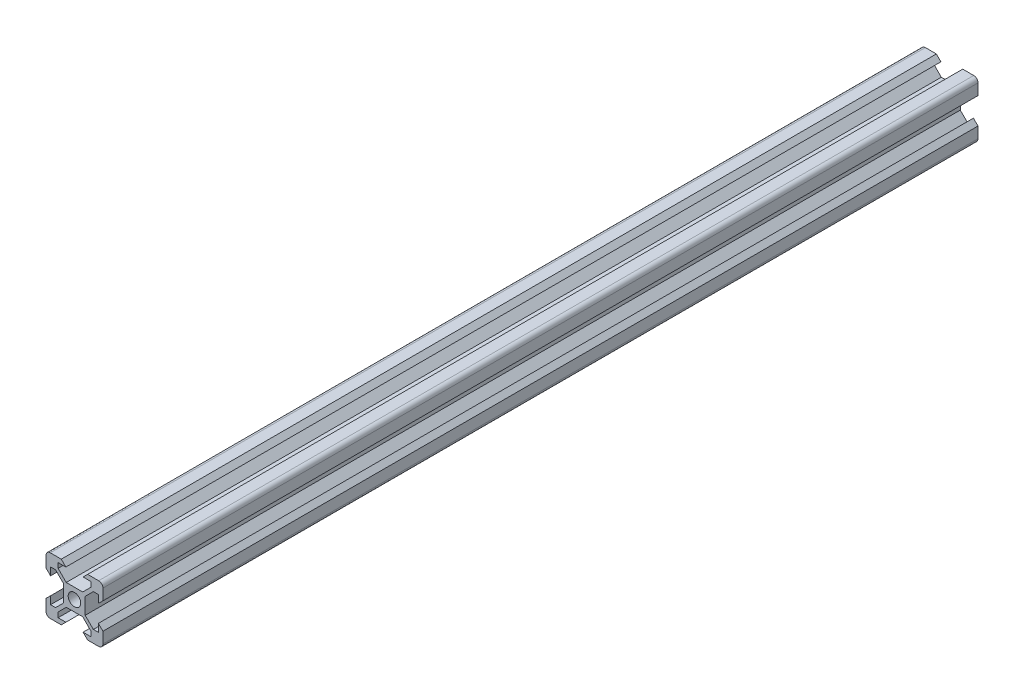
ISO-10303-21;
HEADER;
FILE_DESCRIPTION(('STEP AP214'),'2;1');
FILE_NAME('part.step','',(''),(''),'','','');
FILE_SCHEMA(('AUTOMOTIVE_DESIGN { 1 0 10303 214 1 1 1 1 }'));
ENDSEC;
DATA;
#1=APPLICATION_CONTEXT('core data for automotive mechanical design processes');
#2=APPLICATION_PROTOCOL_DEFINITION('international standard','automotive_design',2000,#1);
#3=PRODUCT_CONTEXT('',#1,'mechanical');
#4=PRODUCT('Part','Part','',(#3));
#5=PRODUCT_RELATED_PRODUCT_CATEGORY('part','',(#4));
#6=PRODUCT_DEFINITION_FORMATION('','',#4);
#7=PRODUCT_DEFINITION_CONTEXT('part definition',#1,'design');
#8=PRODUCT_DEFINITION('design','',#6,#7);
#9=PRODUCT_DEFINITION_SHAPE('','',#8);
#10=(LENGTH_UNIT() NAMED_UNIT(*) SI_UNIT(.MILLI.,.METRE.));
#11=(NAMED_UNIT(*) PLANE_ANGLE_UNIT() SI_UNIT($,.RADIAN.));
#12=(NAMED_UNIT(*) SI_UNIT($,.STERADIAN.) SOLID_ANGLE_UNIT());
#13=UNCERTAINTY_MEASURE_WITH_UNIT(LENGTH_MEASURE(1.E-05),#10,'distance_accuracy_value','');
#14=(GEOMETRIC_REPRESENTATION_CONTEXT(3) GLOBAL_UNCERTAINTY_ASSIGNED_CONTEXT((#13)) GLOBAL_UNIT_ASSIGNED_CONTEXT((#10,
#11,#12)) REPRESENTATION_CONTEXT('',''));
#15=CARTESIAN_POINT('',(0.,0.,0.));
#16=DIRECTION('',(0.,0.,1.));
#17=DIRECTION('',(1.,0.,0.));
#18=AXIS2_PLACEMENT_3D('',#15,#16,#17);
#19=CARTESIAN_POINT('',(7.544,0.,307.5));
#20=DIRECTION('',(1.,0.,0.));
#21=DIRECTION('',(0.,0.,-1.));
#22=AXIS2_PLACEMENT_3D('',#19,#20,#21);
#23=PLANE('',#22);
#24=DIRECTION('',(0.,-1.,0.));
#25=VECTOR('',#24,1.);
#26=CARTESIAN_POINT('',(7.544,0.,-307.5));
#27=LINE('',#26,#25);
#28=CARTESIAN_POINT('',(7.544,5.78471832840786,-307.5));
#29=VERTEX_POINT('',#28);
#30=CARTESIAN_POINT('',(7.544,-5.78471832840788,-307.5));
#31=VERTEX_POINT('',#30);
#32=EDGE_CURVE('E378',#29,#31,#27,.T.);
#33=ORIENTED_EDGE('',*,*,#32,.F.);
#34=DIRECTION('',(0.,0.,-1.));
#35=VECTOR('',#34,1.);
#36=CARTESIAN_POINT('',(7.544,5.78471832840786,307.5));
#37=LINE('',#36,#35);
#38=CARTESIAN_POINT('',(7.544,5.78471832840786,307.5));
#39=VERTEX_POINT('',#38);
#40=EDGE_CURVE('E11',#39,#29,#37,.T.);
#41=ORIENTED_EDGE('',*,*,#40,.F.);
#42=DIRECTION('',(0.,-1.,0.));
#43=VECTOR('',#42,1.);
#44=CARTESIAN_POINT('',(7.544,0.,307.5));
#45=LINE('',#44,#43);
#46=CARTESIAN_POINT('',(7.544,-5.78471832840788,307.5));
#47=VERTEX_POINT('',#46);
#48=EDGE_CURVE('E478',#39,#47,#45,.T.);
#49=ORIENTED_EDGE('',*,*,#48,.T.);
#50=DIRECTION('',(0.,0.,-1.));
#51=VECTOR('',#50,1.);
#52=CARTESIAN_POINT('',(7.544,-5.78471832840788,307.5));
#53=LINE('',#52,#51);
#54=EDGE_CURVE('E212',#47,#31,#53,.T.);
#55=ORIENTED_EDGE('',*,*,#54,.T.);
#56=EDGE_LOOP('',(#33,#41,#49,#55));
#57=FACE_BOUND('',#56,.T.);
#58=ADVANCED_FACE('F41',(#57),#23,.T.);
#59=CARTESIAN_POINT('',(0.879640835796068,-0.879640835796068,307.5));
#60=DIRECTION('',(-0.707106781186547,0.707106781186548,0.));
#61=DIRECTION('',(-0.707106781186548,-0.707106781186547,0.));
#62=AXIS2_PLACEMENT_3D('',#59,#60,#61);
#63=PLANE('',#62);
#64=DIRECTION('',(0.707106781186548,0.707106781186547,0.));
#65=VECTOR('',#64,1.);
#66=CARTESIAN_POINT('',(0.879640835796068,-0.879640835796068,-307.5));
#67=LINE('',#66,#65);
#68=CARTESIAN_POINT('',(13.2712816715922,11.512,-307.5));
#69=VERTEX_POINT('',#68);
#70=EDGE_CURVE('E381',#29,#69,#67,.T.);
#71=ORIENTED_EDGE('',*,*,#70,.T.);
#72=DIRECTION('',(0.,0.,-1.));
#73=VECTOR('',#72,1.);
#74=CARTESIAN_POINT('',(13.2712816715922,11.512,307.5));
#75=LINE('',#74,#73);
#76=CARTESIAN_POINT('',(13.2712816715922,11.512,307.5));
#77=VERTEX_POINT('',#76);
#78=EDGE_CURVE('E49',#77,#69,#75,.T.);
#79=ORIENTED_EDGE('',*,*,#78,.F.);
#80=DIRECTION('',(0.707106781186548,0.707106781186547,0.));
#81=VECTOR('',#80,1.);
#82=CARTESIAN_POINT('',(0.879640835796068,-0.879640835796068,307.5));
#83=LINE('',#82,#81);
#84=EDGE_CURVE('E727',#39,#77,#83,.T.);
#85=ORIENTED_EDGE('',*,*,#84,.F.);
#86=ORIENTED_EDGE('',*,*,#40,.T.);
#87=EDGE_LOOP('',(#71,#79,#85,#86));
#88=FACE_BOUND('',#87,.T.);
#89=ADVANCED_FACE('F730',(#88),#63,.F.);
#90=CARTESIAN_POINT('',(0.,11.512,307.5));
#91=DIRECTION('',(0.,1.,0.));
#92=DIRECTION('',(0.,0.,1.));
#93=AXIS2_PLACEMENT_3D('',#90,#91,#92);
#94=PLANE('',#93);
#95=DIRECTION('',(1.,0.,0.));
#96=VECTOR('',#95,1.);
#97=CARTESIAN_POINT('',(0.,11.512,-307.5));
#98=LINE('',#97,#96);
#99=CARTESIAN_POINT('',(16.8,11.512,-307.5));
#100=VERTEX_POINT('',#99);
#101=EDGE_CURVE('E383',#69,#100,#98,.T.);
#102=ORIENTED_EDGE('',*,*,#101,.T.);
#103=DIRECTION('',(0.,0.,-1.));
#104=VECTOR('',#103,1.);
#105=CARTESIAN_POINT('',(16.8,11.512,307.5));
#106=LINE('',#105,#104);
#107=CARTESIAN_POINT('',(16.8,11.512,307.5));
#108=VERTEX_POINT('',#107);
#109=EDGE_CURVE('E603',#108,#100,#106,.T.);
#110=ORIENTED_EDGE('',*,*,#109,.F.);
#111=DIRECTION('',(1.,0.,0.));
#112=VECTOR('',#111,1.);
#113=CARTESIAN_POINT('',(0.,11.512,307.5));
#114=LINE('',#113,#112);
#115=EDGE_CURVE('E612',#77,#108,#114,.T.);
#116=ORIENTED_EDGE('',*,*,#115,.F.);
#117=ORIENTED_EDGE('',*,*,#78,.T.);
#118=EDGE_LOOP('',(#102,#110,#116,#117));
#119=FACE_BOUND('',#118,.T.);
#120=ADVANCED_FACE('F610',(#119),#94,.F.);
#121=CARTESIAN_POINT('',(16.8,0.,307.5));
#122=DIRECTION('',(1.,0.,0.));
#123=DIRECTION('',(0.,0.,-1.));
#124=AXIS2_PLACEMENT_3D('',#121,#122,#123);
#125=PLANE('',#124);
#126=DIRECTION('',(0.,-1.,0.));
#127=VECTOR('',#126,1.);
#128=CARTESIAN_POINT('',(16.8,0.,-307.5));
#129=LINE('',#128,#127);
#130=CARTESIAN_POINT('',(16.8,6.05197692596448,-307.5));
#131=VERTEX_POINT('',#130);
#132=EDGE_CURVE('E385',#100,#131,#129,.T.);
#133=ORIENTED_EDGE('',*,*,#132,.T.);
#134=DIRECTION('',(0.,0.,-1.));
#135=VECTOR('',#134,1.);
#136=CARTESIAN_POINT('',(16.8,6.05197692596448,307.5));
#137=LINE('',#136,#135);
#138=CARTESIAN_POINT('',(16.8,6.05197692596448,307.5));
#139=VERTEX_POINT('',#138);
#140=EDGE_CURVE('E600',#139,#131,#137,.T.);
#141=ORIENTED_EDGE('',*,*,#140,.F.);
#142=DIRECTION('',(0.,-1.,0.));
#143=VECTOR('',#142,1.);
#144=CARTESIAN_POINT('',(16.8,0.,307.5));
#145=LINE('',#144,#143);
#146=EDGE_CURVE('E632',#108,#139,#145,.T.);
#147=ORIENTED_EDGE('',*,*,#146,.F.);
#148=ORIENTED_EDGE('',*,*,#109,.T.);
#149=EDGE_LOOP('',(#133,#141,#147,#148));
#150=FACE_BOUND('',#149,.T.);
#151=ADVANCED_FACE('F623',(#150),#125,.F.);
#152=CARTESIAN_POINT('',(5.37401153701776,-5.37401153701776,307.5));
#153=DIRECTION('',(-0.707106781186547,0.707106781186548,0.));
#154=DIRECTION('',(-0.707106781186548,-0.707106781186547,0.));
#155=AXIS2_PLACEMENT_3D('',#152,#153,#154);
#156=PLANE('',#155);
#157=DIRECTION('',(0.707106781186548,0.707106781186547,0.));
#158=VECTOR('',#157,1.);
#159=CARTESIAN_POINT('',(5.37401153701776,-5.37401153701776,-307.5));
#160=LINE('',#159,#158);
#161=CARTESIAN_POINT('',(20.,9.25197692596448,-307.5));
#162=VERTEX_POINT('',#161);
#163=EDGE_CURVE('E387',#131,#162,#160,.T.);
#164=ORIENTED_EDGE('',*,*,#163,.T.);
#165=DIRECTION('',(0.,0.,-1.));
#166=VECTOR('',#165,1.);
#167=CARTESIAN_POINT('',(20.,9.25197692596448,307.5));
#168=LINE('',#167,#166);
#169=CARTESIAN_POINT('',(20.,9.25197692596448,307.5));
#170=VERTEX_POINT('',#169);
#171=EDGE_CURVE('E597',#170,#162,#168,.T.);
#172=ORIENTED_EDGE('',*,*,#171,.F.);
#173=DIRECTION('',(0.707106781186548,0.707106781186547,0.));
#174=VECTOR('',#173,1.);
#175=CARTESIAN_POINT('',(5.37401153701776,-5.37401153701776,307.5));
#176=LINE('',#175,#174);
#177=EDGE_CURVE('E629',#139,#170,#176,.T.);
#178=ORIENTED_EDGE('',*,*,#177,.F.);
#179=ORIENTED_EDGE('',*,*,#140,.T.);
#180=EDGE_LOOP('',(#164,#172,#178,#179));
#181=FACE_BOUND('',#180,.T.);
#182=ADVANCED_FACE('F627',(#181),#156,.F.);
#183=CARTESIAN_POINT('',(20.,0.,307.5));
#184=DIRECTION('',(-1.,0.,0.));
#185=DIRECTION('',(0.,0.,1.));
#186=AXIS2_PLACEMENT_3D('',#183,#184,#185);
#187=PLANE('',#186);
#188=DIRECTION('',(0.,1.,0.));
#189=VECTOR('',#188,1.);
#190=CARTESIAN_POINT('',(20.,0.,-307.5));
#191=LINE('',#190,#189);
#192=CARTESIAN_POINT('',(20.,17.,-307.5));
#193=VERTEX_POINT('',#192);
#194=EDGE_CURVE('E389',#162,#193,#191,.T.);
#195=ORIENTED_EDGE('',*,*,#194,.T.);
#196=DIRECTION('',(0.,0.,-1.));
#197=VECTOR('',#196,1.);
#198=CARTESIAN_POINT('',(20.,17.,307.5));
#199=LINE('',#198,#197);
#200=CARTESIAN_POINT('',(20.,17.,307.5));
#201=VERTEX_POINT('',#200);
#202=EDGE_CURVE('E594',#201,#193,#199,.T.);
#203=ORIENTED_EDGE('',*,*,#202,.F.);
#204=DIRECTION('',(0.,1.,0.));
#205=VECTOR('',#204,1.);
#206=CARTESIAN_POINT('',(20.,0.,307.5));
#207=LINE('',#206,#205);
#208=EDGE_CURVE('E631',#170,#201,#207,.T.);
#209=ORIENTED_EDGE('',*,*,#208,.F.);
#210=ORIENTED_EDGE('',*,*,#171,.T.);
#211=EDGE_LOOP('',(#195,#203,#209,#210));
#212=FACE_BOUND('',#211,.T.);
#213=ADVANCED_FACE('F742',(#212),#187,.F.);
#214=CARTESIAN_POINT('',(17.,17.,307.5));
#215=DIRECTION('',(0.,0.,-1.));
#216=DIRECTION('',(-1.,0.,0.));
#217=AXIS2_PLACEMENT_3D('',#214,#215,#216);
#218=CYLINDRICAL_SURFACE('',#217,3.);
#219=CARTESIAN_POINT('',(17.,17.,-307.5));
#220=DIRECTION('',(0.,0.,1.));
#221=DIRECTION('',(1.,0.,0.));
#222=AXIS2_PLACEMENT_3D('',#219,#220,#221);
#223=CIRCLE('',#222,3.);
#224=CARTESIAN_POINT('',(17.,20.,-307.5));
#225=VERTEX_POINT('',#224);
#226=EDGE_CURVE('E391',#193,#225,#223,.T.);
#227=ORIENTED_EDGE('',*,*,#226,.T.);
#228=DIRECTION('',(0.,0.,-1.));
#229=VECTOR('',#228,1.);
#230=CARTESIAN_POINT('',(17.,20.,307.5));
#231=LINE('',#230,#229);
#232=CARTESIAN_POINT('',(17.,20.,307.5));
#233=VERTEX_POINT('',#232);
#234=EDGE_CURVE('E591',#233,#225,#231,.T.);
#235=ORIENTED_EDGE('',*,*,#234,.F.);
#236=CARTESIAN_POINT('',(17.,17.,307.5));
#237=DIRECTION('',(0.,0.,1.));
#238=DIRECTION('',(1.,0.,0.));
#239=AXIS2_PLACEMENT_3D('',#236,#237,#238);
#240=CIRCLE('',#239,3.);
#241=EDGE_CURVE('E634',#201,#233,#240,.T.);
#242=ORIENTED_EDGE('',*,*,#241,.F.);
#243=ORIENTED_EDGE('',*,*,#202,.T.);
#244=EDGE_LOOP('',(#227,#235,#242,#243));
#245=FACE_BOUND('',#244,.T.);
#246=ADVANCED_FACE('F745',(#245),#218,.T.);
#247=CARTESIAN_POINT('',(0.,20.,307.5));
#248=DIRECTION('',(0.,-1.,0.));
#249=DIRECTION('',(1.,0.,0.));
#250=AXIS2_PLACEMENT_3D('',#247,#248,#249);
#251=PLANE('',#250);
#252=DIRECTION('',(-1.,0.,0.));
#253=VECTOR('',#252,1.);
#254=CARTESIAN_POINT('',(0.,20.,-307.5));
#255=LINE('',#254,#253);
#256=CARTESIAN_POINT('',(9.2519769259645,20.,-307.5));
#257=VERTEX_POINT('',#256);
#258=EDGE_CURVE('E393',#225,#257,#255,.T.);
#259=ORIENTED_EDGE('',*,*,#258,.T.);
#260=DIRECTION('',(0.,0.,-1.));
#261=VECTOR('',#260,1.);
#262=CARTESIAN_POINT('',(9.2519769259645,20.,307.5));
#263=LINE('',#262,#261);
#264=CARTESIAN_POINT('',(9.2519769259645,20.,307.5));
#265=VERTEX_POINT('',#264);
#266=EDGE_CURVE('E588',#265,#257,#263,.T.);
#267=ORIENTED_EDGE('',*,*,#266,.F.);
#268=DIRECTION('',(-1.,0.,0.));
#269=VECTOR('',#268,1.);
#270=CARTESIAN_POINT('',(0.,20.,307.5));
#271=LINE('',#270,#269);
#272=EDGE_CURVE('E640',#233,#265,#271,.T.);
#273=ORIENTED_EDGE('',*,*,#272,.F.);
#274=ORIENTED_EDGE('',*,*,#234,.T.);
#275=EDGE_LOOP('',(#259,#267,#273,#274));
#276=FACE_BOUND('',#275,.T.);
#277=ADVANCED_FACE('F749',(#276),#251,.F.);
#278=CARTESIAN_POINT('',(-5.37401153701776,5.37401153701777,307.5));
#279=DIRECTION('',(0.707106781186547,-0.707106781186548,0.));
#280=DIRECTION('',(0.707106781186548,0.707106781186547,0.));
#281=AXIS2_PLACEMENT_3D('',#278,#279,#280);
#282=PLANE('',#281);
#283=DIRECTION('',(-0.707106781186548,-0.707106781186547,0.));
#284=VECTOR('',#283,1.);
#285=CARTESIAN_POINT('',(-5.37401153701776,5.37401153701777,-307.5));
#286=LINE('',#285,#284);
#287=CARTESIAN_POINT('',(6.05197692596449,16.8,-307.5));
#288=VERTEX_POINT('',#287);
#289=EDGE_CURVE('E395',#257,#288,#286,.T.);
#290=ORIENTED_EDGE('',*,*,#289,.T.);
#291=DIRECTION('',(0.,0.,-1.));
#292=VECTOR('',#291,1.);
#293=CARTESIAN_POINT('',(6.05197692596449,16.8,307.5));
#294=LINE('',#293,#292);
#295=CARTESIAN_POINT('',(6.05197692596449,16.8,307.5));
#296=VERTEX_POINT('',#295);
#297=EDGE_CURVE('E585',#296,#288,#294,.T.);
#298=ORIENTED_EDGE('',*,*,#297,.F.);
#299=DIRECTION('',(-0.707106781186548,-0.707106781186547,0.));
#300=VECTOR('',#299,1.);
#301=CARTESIAN_POINT('',(-5.37401153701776,5.37401153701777,307.5));
#302=LINE('',#301,#300);
#303=EDGE_CURVE('E642',#265,#296,#302,.T.);
#304=ORIENTED_EDGE('',*,*,#303,.F.);
#305=ORIENTED_EDGE('',*,*,#266,.T.);
#306=EDGE_LOOP('',(#290,#298,#304,#305));
#307=FACE_BOUND('',#306,.T.);
#308=ADVANCED_FACE('F753',(#307),#282,.F.);
#309=CARTESIAN_POINT('',(0.,16.8,307.5));
#310=DIRECTION('',(0.,1.,0.));
#311=DIRECTION('',(0.,0.,1.));
#312=AXIS2_PLACEMENT_3D('',#309,#310,#311);
#313=PLANE('',#312);
#314=DIRECTION('',(1.,0.,0.));
#315=VECTOR('',#314,1.);
#316=CARTESIAN_POINT('',(0.,16.8,-307.5));
#317=LINE('',#316,#315);
#318=CARTESIAN_POINT('',(11.512,16.8,-307.5));
#319=VERTEX_POINT('',#318);
#320=EDGE_CURVE('E397',#288,#319,#317,.T.);
#321=ORIENTED_EDGE('',*,*,#320,.T.);
#322=DIRECTION('',(0.,0.,-1.));
#323=VECTOR('',#322,1.);
#324=CARTESIAN_POINT('',(11.512,16.8,307.5));
#325=LINE('',#324,#323);
#326=CARTESIAN_POINT('',(11.512,16.8,307.5));
#327=VERTEX_POINT('',#326);
#328=EDGE_CURVE('E582',#327,#319,#325,.T.);
#329=ORIENTED_EDGE('',*,*,#328,.F.);
#330=DIRECTION('',(1.,0.,0.));
#331=VECTOR('',#330,1.);
#332=CARTESIAN_POINT('',(0.,16.8,307.5));
#333=LINE('',#332,#331);
#334=EDGE_CURVE('E644',#296,#327,#333,.T.);
#335=ORIENTED_EDGE('',*,*,#334,.F.);
#336=ORIENTED_EDGE('',*,*,#297,.T.);
#337=EDGE_LOOP('',(#321,#329,#335,#336));
#338=FACE_BOUND('',#337,.T.);
#339=ADVANCED_FACE('F757',(#338),#313,.F.);
#340=CARTESIAN_POINT('',(11.512,0.,307.5));
#341=DIRECTION('',(1.,0.,0.));
#342=DIRECTION('',(0.,0.,-1.));
#343=AXIS2_PLACEMENT_3D('',#340,#341,#342);
#344=PLANE('',#343);
#345=DIRECTION('',(0.,-1.,0.));
#346=VECTOR('',#345,1.);
#347=CARTESIAN_POINT('',(11.512,0.,-307.5));
#348=LINE('',#347,#346);
#349=CARTESIAN_POINT('',(11.512,13.2712816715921,-307.5));
#350=VERTEX_POINT('',#349);
#351=EDGE_CURVE('E399',#319,#350,#348,.T.);
#352=ORIENTED_EDGE('',*,*,#351,.T.);
#353=DIRECTION('',(0.,0.,-1.));
#354=VECTOR('',#353,1.);
#355=CARTESIAN_POINT('',(11.512,13.2712816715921,307.5));
#356=LINE('',#355,#354);
#357=CARTESIAN_POINT('',(11.512,13.2712816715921,307.5));
#358=VERTEX_POINT('',#357);
#359=EDGE_CURVE('E579',#358,#350,#356,.T.);
#360=ORIENTED_EDGE('',*,*,#359,.F.);
#361=DIRECTION('',(0.,-1.,0.));
#362=VECTOR('',#361,1.);
#363=CARTESIAN_POINT('',(11.512,0.,307.5));
#364=LINE('',#363,#362);
#365=EDGE_CURVE('E646',#327,#358,#364,.T.);
#366=ORIENTED_EDGE('',*,*,#365,.F.);
#367=ORIENTED_EDGE('',*,*,#328,.T.);
#368=EDGE_LOOP('',(#352,#360,#366,#367));
#369=FACE_BOUND('',#368,.T.);
#370=ADVANCED_FACE('F761',(#369),#344,.F.);
#371=CARTESIAN_POINT('',(-0.879640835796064,0.879640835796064,307.5));
#372=DIRECTION('',(0.707106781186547,-0.707106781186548,0.));
#373=DIRECTION('',(0.707106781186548,0.707106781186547,0.));
#374=AXIS2_PLACEMENT_3D('',#371,#372,#373);
#375=PLANE('',#374);
#376=DIRECTION('',(-0.707106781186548,-0.707106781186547,0.));
#377=VECTOR('',#376,1.);
#378=CARTESIAN_POINT('',(-0.879640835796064,0.879640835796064,-307.5));
#379=LINE('',#378,#377);
#380=CARTESIAN_POINT('',(5.78471832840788,7.544,-307.5));
#381=VERTEX_POINT('',#380);
#382=EDGE_CURVE('E401',#350,#381,#379,.T.);
#383=ORIENTED_EDGE('',*,*,#382,.T.);
#384=DIRECTION('',(0.,0.,-1.));
#385=VECTOR('',#384,1.);
#386=CARTESIAN_POINT('',(5.78471832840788,7.544,307.5));
#387=LINE('',#386,#385);
#388=CARTESIAN_POINT('',(5.78471832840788,7.544,307.5));
#389=VERTEX_POINT('',#388);
#390=EDGE_CURVE('E577',#389,#381,#387,.T.);
#391=ORIENTED_EDGE('',*,*,#390,.F.);
#392=DIRECTION('',(-0.707106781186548,-0.707106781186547,0.));
#393=VECTOR('',#392,1.);
#394=CARTESIAN_POINT('',(-0.879640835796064,0.879640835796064,307.5));
#395=LINE('',#394,#393);
#396=EDGE_CURVE('E648',#358,#389,#395,.T.);
#397=ORIENTED_EDGE('',*,*,#396,.F.);
#398=ORIENTED_EDGE('',*,*,#359,.T.);
#399=EDGE_LOOP('',(#383,#391,#397,#398));
#400=FACE_BOUND('',#399,.T.);
#401=ADVANCED_FACE('F765',(#400),#375,.F.);
#402=CARTESIAN_POINT('',(0.,7.54400000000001,307.5));
#403=DIRECTION('',(0.,1.,0.));
#404=DIRECTION('',(-1.,0.,0.));
#405=AXIS2_PLACEMENT_3D('',#402,#403,#404);
#406=PLANE('',#405);
#407=DIRECTION('',(1.,0.,0.));
#408=VECTOR('',#407,1.);
#409=CARTESIAN_POINT('',(0.,7.54400000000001,-307.5));
#410=LINE('',#409,#408);
#411=CARTESIAN_POINT('',(-5.78471832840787,7.54400000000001,-307.5));
#412=VERTEX_POINT('',#411);
#413=EDGE_CURVE('E404',#412,#381,#410,.T.);
#414=ORIENTED_EDGE('',*,*,#413,.F.);
#415=DIRECTION('',(0.,0.,-1.));
#416=VECTOR('',#415,1.);
#417=CARTESIAN_POINT('',(-5.78471832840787,7.54400000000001,307.5));
#418=LINE('',#417,#416);
#419=CARTESIAN_POINT('',(-5.78471832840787,7.54400000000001,307.5));
#420=VERTEX_POINT('',#419);
#421=EDGE_CURVE('E575',#420,#412,#418,.T.);
#422=ORIENTED_EDGE('',*,*,#421,.F.);
#423=DIRECTION('',(1.,0.,0.));
#424=VECTOR('',#423,1.);
#425=CARTESIAN_POINT('',(0.,7.54400000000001,307.5));
#426=LINE('',#425,#424);
#427=EDGE_CURVE('E650',#420,#389,#426,.T.);
#428=ORIENTED_EDGE('',*,*,#427,.T.);
#429=ORIENTED_EDGE('',*,*,#390,.T.);
#430=EDGE_LOOP('',(#414,#422,#428,#429));
#431=FACE_BOUND('',#430,.T.);
#432=ADVANCED_FACE('F769',(#431),#406,.T.);
#433=CARTESIAN_POINT('',(0.879640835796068,0.879640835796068,307.5));
#434=DIRECTION('',(-0.707106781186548,-0.707106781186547,0.));
#435=DIRECTION('',(0.707106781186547,-0.707106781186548,0.));
#436=AXIS2_PLACEMENT_3D('',#433,#434,#435);
#437=PLANE('',#436);
#438=DIRECTION('',(-0.707106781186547,0.707106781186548,0.));
#439=VECTOR('',#438,1.);
#440=CARTESIAN_POINT('',(0.879640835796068,0.879640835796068,-307.5));
#441=LINE('',#440,#439);
#442=CARTESIAN_POINT('',(-11.512,13.2712816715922,-307.5));
#443=VERTEX_POINT('',#442);
#444=EDGE_CURVE('E407',#412,#443,#441,.T.);
#445=ORIENTED_EDGE('',*,*,#444,.T.);
#446=DIRECTION('',(0.,0.,-1.));
#447=VECTOR('',#446,1.);
#448=CARTESIAN_POINT('',(-11.512,13.2712816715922,307.5));
#449=LINE('',#448,#447);
#450=CARTESIAN_POINT('',(-11.512,13.2712816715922,307.5));
#451=VERTEX_POINT('',#450);
#452=EDGE_CURVE('E572',#451,#443,#449,.T.);
#453=ORIENTED_EDGE('',*,*,#452,.F.);
#454=DIRECTION('',(-0.707106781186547,0.707106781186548,0.));
#455=VECTOR('',#454,1.);
#456=CARTESIAN_POINT('',(0.879640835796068,0.879640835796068,307.5));
#457=LINE('',#456,#455);
#458=EDGE_CURVE('E653',#420,#451,#457,.T.);
#459=ORIENTED_EDGE('',*,*,#458,.F.);
#460=ORIENTED_EDGE('',*,*,#421,.T.);
#461=EDGE_LOOP('',(#445,#453,#459,#460));
#462=FACE_BOUND('',#461,.T.);
#463=ADVANCED_FACE('F773',(#462),#437,.F.);
#464=CARTESIAN_POINT('',(-11.512,0.,307.5));
#465=DIRECTION('',(-1.,0.,0.));
#466=DIRECTION('',(0.,0.,1.));
#467=AXIS2_PLACEMENT_3D('',#464,#465,#466);
#468=PLANE('',#467);
#469=DIRECTION('',(0.,1.,0.));
#470=VECTOR('',#469,1.);
#471=CARTESIAN_POINT('',(-11.512,0.,-307.5));
#472=LINE('',#471,#470);
#473=CARTESIAN_POINT('',(-11.512,16.8,-307.5));
#474=VERTEX_POINT('',#473);
#475=EDGE_CURVE('E409',#443,#474,#472,.T.);
#476=ORIENTED_EDGE('',*,*,#475,.T.);
#477=DIRECTION('',(0.,0.,-1.));
#478=VECTOR('',#477,1.);
#479=CARTESIAN_POINT('',(-11.512,16.8,307.5));
#480=LINE('',#479,#478);
#481=CARTESIAN_POINT('',(-11.512,16.8,307.5));
#482=VERTEX_POINT('',#481);
#483=EDGE_CURVE('E569',#482,#474,#480,.T.);
#484=ORIENTED_EDGE('',*,*,#483,.F.);
#485=DIRECTION('',(0.,1.,0.));
#486=VECTOR('',#485,1.);
#487=CARTESIAN_POINT('',(-11.512,0.,307.5));
#488=LINE('',#487,#486);
#489=EDGE_CURVE('E655',#451,#482,#488,.T.);
#490=ORIENTED_EDGE('',*,*,#489,.F.);
#491=ORIENTED_EDGE('',*,*,#452,.T.);
#492=EDGE_LOOP('',(#476,#484,#490,#491));
#493=FACE_BOUND('',#492,.T.);
#494=ADVANCED_FACE('F777',(#493),#468,.F.);
#495=CARTESIAN_POINT('',(0.,16.8,307.5));
#496=DIRECTION('',(0.,1.,0.));
#497=DIRECTION('',(0.,0.,1.));
#498=AXIS2_PLACEMENT_3D('',#495,#496,#497);
#499=PLANE('',#498);
#500=DIRECTION('',(1.,0.,0.));
#501=VECTOR('',#500,1.);
#502=CARTESIAN_POINT('',(0.,16.8,-307.5));
#503=LINE('',#502,#501);
#504=CARTESIAN_POINT('',(-6.05197692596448,16.8,-307.5));
#505=VERTEX_POINT('',#504);
#506=EDGE_CURVE('E411',#474,#505,#503,.T.);
#507=ORIENTED_EDGE('',*,*,#506,.T.);
#508=DIRECTION('',(0.,0.,-1.));
#509=VECTOR('',#508,1.);
#510=CARTESIAN_POINT('',(-6.05197692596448,16.8,307.5));
#511=LINE('',#510,#509);
#512=CARTESIAN_POINT('',(-6.05197692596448,16.8,307.5));
#513=VERTEX_POINT('',#512);
#514=EDGE_CURVE('E566',#513,#505,#511,.T.);
#515=ORIENTED_EDGE('',*,*,#514,.F.);
#516=DIRECTION('',(1.,0.,0.));
#517=VECTOR('',#516,1.);
#518=CARTESIAN_POINT('',(0.,16.8,307.5));
#519=LINE('',#518,#517);
#520=EDGE_CURVE('E657',#482,#513,#519,.T.);
#521=ORIENTED_EDGE('',*,*,#520,.F.);
#522=ORIENTED_EDGE('',*,*,#483,.T.);
#523=EDGE_LOOP('',(#507,#515,#521,#522));
#524=FACE_BOUND('',#523,.T.);
#525=ADVANCED_FACE('F781',(#524),#499,.F.);
#526=CARTESIAN_POINT('',(5.37401153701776,5.37401153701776,307.5));
#527=DIRECTION('',(-0.707106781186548,-0.707106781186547,0.));
#528=DIRECTION('',(0.707106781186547,-0.707106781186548,0.));
#529=AXIS2_PLACEMENT_3D('',#526,#527,#528);
#530=PLANE('',#529);
#531=DIRECTION('',(-0.707106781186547,0.707106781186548,0.));
#532=VECTOR('',#531,1.);
#533=CARTESIAN_POINT('',(5.37401153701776,5.37401153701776,-307.5));
#534=LINE('',#533,#532);
#535=CARTESIAN_POINT('',(-9.25197692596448,20.,-307.5));
#536=VERTEX_POINT('',#535);
#537=EDGE_CURVE('E413',#505,#536,#534,.T.);
#538=ORIENTED_EDGE('',*,*,#537,.T.);
#539=DIRECTION('',(0.,0.,-1.));
#540=VECTOR('',#539,1.);
#541=CARTESIAN_POINT('',(-9.25197692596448,20.,307.5));
#542=LINE('',#541,#540);
#543=CARTESIAN_POINT('',(-9.25197692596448,20.,307.5));
#544=VERTEX_POINT('',#543);
#545=EDGE_CURVE('E563',#544,#536,#542,.T.);
#546=ORIENTED_EDGE('',*,*,#545,.F.);
#547=DIRECTION('',(-0.707106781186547,0.707106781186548,0.));
#548=VECTOR('',#547,1.);
#549=CARTESIAN_POINT('',(5.37401153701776,5.37401153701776,307.5));
#550=LINE('',#549,#548);
#551=EDGE_CURVE('E659',#513,#544,#550,.T.);
#552=ORIENTED_EDGE('',*,*,#551,.F.);
#553=ORIENTED_EDGE('',*,*,#514,.T.);
#554=EDGE_LOOP('',(#538,#546,#552,#553));
#555=FACE_BOUND('',#554,.T.);
#556=ADVANCED_FACE('F785',(#555),#530,.F.);
#557=CARTESIAN_POINT('',(0.,20.,307.5));
#558=DIRECTION('',(0.,-1.,0.));
#559=DIRECTION('',(0.,0.,-1.));
#560=AXIS2_PLACEMENT_3D('',#557,#558,#559);
#561=PLANE('',#560);
#562=DIRECTION('',(-1.,0.,0.));
#563=VECTOR('',#562,1.);
#564=CARTESIAN_POINT('',(0.,20.,-307.5));
#565=LINE('',#564,#563);
#566=CARTESIAN_POINT('',(-17.,20.,-307.5));
#567=VERTEX_POINT('',#566);
#568=EDGE_CURVE('E415',#536,#567,#565,.T.);
#569=ORIENTED_EDGE('',*,*,#568,.T.);
#570=DIRECTION('',(0.,0.,-1.));
#571=VECTOR('',#570,1.);
#572=CARTESIAN_POINT('',(-17.,20.,307.5));
#573=LINE('',#572,#571);
#574=CARTESIAN_POINT('',(-17.,20.,307.5));
#575=VERTEX_POINT('',#574);
#576=EDGE_CURVE('E560',#575,#567,#573,.T.);
#577=ORIENTED_EDGE('',*,*,#576,.F.);
#578=DIRECTION('',(-1.,0.,0.));
#579=VECTOR('',#578,1.);
#580=CARTESIAN_POINT('',(0.,20.,307.5));
#581=LINE('',#580,#579);
#582=EDGE_CURVE('E661',#544,#575,#581,.T.);
#583=ORIENTED_EDGE('',*,*,#582,.F.);
#584=ORIENTED_EDGE('',*,*,#545,.T.);
#585=EDGE_LOOP('',(#569,#577,#583,#584));
#586=FACE_BOUND('',#585,.T.);
#587=ADVANCED_FACE('F789',(#586),#561,.F.);
#588=CARTESIAN_POINT('',(-17.,17.,307.5));
#589=DIRECTION('',(0.,0.,-1.));
#590=DIRECTION('',(-1.,0.,0.));
#591=AXIS2_PLACEMENT_3D('',#588,#589,#590);
#592=CYLINDRICAL_SURFACE('',#591,3.);
#593=CARTESIAN_POINT('',(-17.,17.,-307.5));
#594=DIRECTION('',(0.,0.,1.));
#595=DIRECTION('',(1.,0.,0.));
#596=AXIS2_PLACEMENT_3D('',#593,#594,#595);
#597=CIRCLE('',#596,3.);
#598=CARTESIAN_POINT('',(-20.,17.,-307.5));
#599=VERTEX_POINT('',#598);
#600=EDGE_CURVE('E417',#567,#599,#597,.T.);
#601=ORIENTED_EDGE('',*,*,#600,.T.);
#602=DIRECTION('',(0.,0.,-1.));
#603=VECTOR('',#602,1.);
#604=CARTESIAN_POINT('',(-20.,17.,307.5));
#605=LINE('',#604,#603);
#606=CARTESIAN_POINT('',(-20.,17.,307.5));
#607=VERTEX_POINT('',#606);
#608=EDGE_CURVE('E557',#607,#599,#605,.T.);
#609=ORIENTED_EDGE('',*,*,#608,.F.);
#610=CARTESIAN_POINT('',(-17.,17.,307.5));
#611=DIRECTION('',(0.,0.,1.));
#612=DIRECTION('',(1.,0.,0.));
#613=AXIS2_PLACEMENT_3D('',#610,#611,#612);
#614=CIRCLE('',#613,3.);
#615=EDGE_CURVE('E663',#575,#607,#614,.T.);
#616=ORIENTED_EDGE('',*,*,#615,.F.);
#617=ORIENTED_EDGE('',*,*,#576,.T.);
#618=EDGE_LOOP('',(#601,#609,#616,#617));
#619=FACE_BOUND('',#618,.T.);
#620=ADVANCED_FACE('F793',(#619),#592,.T.);
#621=CARTESIAN_POINT('',(-20.,0.,307.5));
#622=DIRECTION('',(1.,0.,0.));
#623=DIRECTION('',(0.,1.,0.));
#624=AXIS2_PLACEMENT_3D('',#621,#622,#623);
#625=PLANE('',#624);
#626=DIRECTION('',(0.,-1.,0.));
#627=VECTOR('',#626,1.);
#628=CARTESIAN_POINT('',(-20.,0.,-307.5));
#629=LINE('',#628,#627);
#630=CARTESIAN_POINT('',(-20.,9.2519769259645,-307.5));
#631=VERTEX_POINT('',#630);
#632=EDGE_CURVE('E419',#599,#631,#629,.T.);
#633=ORIENTED_EDGE('',*,*,#632,.T.);
#634=DIRECTION('',(0.,0.,-1.));
#635=VECTOR('',#634,1.);
#636=CARTESIAN_POINT('',(-20.,9.2519769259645,307.5));
#637=LINE('',#636,#635);
#638=CARTESIAN_POINT('',(-20.,9.2519769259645,307.5));
#639=VERTEX_POINT('',#638);
#640=EDGE_CURVE('E554',#639,#631,#637,.T.);
#641=ORIENTED_EDGE('',*,*,#640,.F.);
#642=DIRECTION('',(0.,-1.,0.));
#643=VECTOR('',#642,1.);
#644=CARTESIAN_POINT('',(-20.,0.,307.5));
#645=LINE('',#644,#643);
#646=EDGE_CURVE('E665',#607,#639,#645,.T.);
#647=ORIENTED_EDGE('',*,*,#646,.F.);
#648=ORIENTED_EDGE('',*,*,#608,.T.);
#649=EDGE_LOOP('',(#633,#641,#647,#648));
#650=FACE_BOUND('',#649,.T.);
#651=ADVANCED_FACE('F797',(#650),#625,.F.);
#652=CARTESIAN_POINT('',(-5.37401153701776,-5.37401153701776,307.5));
#653=DIRECTION('',(0.707106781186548,0.707106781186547,0.));
#654=DIRECTION('',(-0.707106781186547,0.707106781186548,0.));
#655=AXIS2_PLACEMENT_3D('',#652,#653,#654);
#656=PLANE('',#655);
#657=DIRECTION('',(0.707106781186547,-0.707106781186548,0.));
#658=VECTOR('',#657,1.);
#659=CARTESIAN_POINT('',(-5.37401153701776,-5.37401153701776,-307.5));
#660=LINE('',#659,#658);
#661=CARTESIAN_POINT('',(-16.8,6.05197692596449,-307.5));
#662=VERTEX_POINT('',#661);
#663=EDGE_CURVE('E421',#631,#662,#660,.T.);
#664=ORIENTED_EDGE('',*,*,#663,.T.);
#665=DIRECTION('',(0.,0.,-1.));
#666=VECTOR('',#665,1.);
#667=CARTESIAN_POINT('',(-16.8,6.05197692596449,307.5));
#668=LINE('',#667,#666);
#669=CARTESIAN_POINT('',(-16.8,6.05197692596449,307.5));
#670=VERTEX_POINT('',#669);
#671=EDGE_CURVE('E551',#670,#662,#668,.T.);
#672=ORIENTED_EDGE('',*,*,#671,.F.);
#673=DIRECTION('',(0.707106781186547,-0.707106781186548,0.));
#674=VECTOR('',#673,1.);
#675=CARTESIAN_POINT('',(-5.37401153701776,-5.37401153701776,307.5));
#676=LINE('',#675,#674);
#677=EDGE_CURVE('E667',#639,#670,#676,.T.);
#678=ORIENTED_EDGE('',*,*,#677,.F.);
#679=ORIENTED_EDGE('',*,*,#640,.T.);
#680=EDGE_LOOP('',(#664,#672,#678,#679));
#681=FACE_BOUND('',#680,.T.);
#682=ADVANCED_FACE('F801',(#681),#656,.F.);
#683=CARTESIAN_POINT('',(-16.8,0.,307.5));
#684=DIRECTION('',(-1.,0.,0.));
#685=DIRECTION('',(0.,0.,1.));
#686=AXIS2_PLACEMENT_3D('',#683,#684,#685);
#687=PLANE('',#686);
#688=DIRECTION('',(0.,1.,0.));
#689=VECTOR('',#688,1.);
#690=CARTESIAN_POINT('',(-16.8,0.,-307.5));
#691=LINE('',#690,#689);
#692=CARTESIAN_POINT('',(-16.8,11.512,-307.5));
#693=VERTEX_POINT('',#692);
#694=EDGE_CURVE('E423',#662,#693,#691,.T.);
#695=ORIENTED_EDGE('',*,*,#694,.T.);
#696=DIRECTION('',(0.,0.,-1.));
#697=VECTOR('',#696,1.);
#698=CARTESIAN_POINT('',(-16.8,11.512,307.5));
#699=LINE('',#698,#697);
#700=CARTESIAN_POINT('',(-16.8,11.512,307.5));
#701=VERTEX_POINT('',#700);
#702=EDGE_CURVE('E548',#701,#693,#699,.T.);
#703=ORIENTED_EDGE('',*,*,#702,.F.);
#704=DIRECTION('',(0.,1.,0.));
#705=VECTOR('',#704,1.);
#706=CARTESIAN_POINT('',(-16.8,0.,307.5));
#707=LINE('',#706,#705);
#708=EDGE_CURVE('E669',#670,#701,#707,.T.);
#709=ORIENTED_EDGE('',*,*,#708,.F.);
#710=ORIENTED_EDGE('',*,*,#671,.T.);
#711=EDGE_LOOP('',(#695,#703,#709,#710));
#712=FACE_BOUND('',#711,.T.);
#713=ADVANCED_FACE('F805',(#712),#687,.F.);
#714=CARTESIAN_POINT('',(0.,11.512,307.5));
#715=DIRECTION('',(0.,1.,0.));
#716=DIRECTION('',(0.,0.,1.));
#717=AXIS2_PLACEMENT_3D('',#714,#715,#716);
#718=PLANE('',#717);
#719=DIRECTION('',(1.,0.,0.));
#720=VECTOR('',#719,1.);
#721=CARTESIAN_POINT('',(0.,11.512,-307.5));
#722=LINE('',#721,#720);
#723=CARTESIAN_POINT('',(-13.2712816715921,11.512,-307.5));
#724=VERTEX_POINT('',#723);
#725=EDGE_CURVE('E425',#693,#724,#722,.T.);
#726=ORIENTED_EDGE('',*,*,#725,.T.);
#727=DIRECTION('',(0.,0.,-1.));
#728=VECTOR('',#727,1.);
#729=CARTESIAN_POINT('',(-13.2712816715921,11.512,307.5));
#730=LINE('',#729,#728);
#731=CARTESIAN_POINT('',(-13.2712816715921,11.512,307.5));
#732=VERTEX_POINT('',#731);
#733=EDGE_CURVE('E545',#732,#724,#730,.T.);
#734=ORIENTED_EDGE('',*,*,#733,.F.);
#735=DIRECTION('',(1.,0.,0.));
#736=VECTOR('',#735,1.);
#737=CARTESIAN_POINT('',(0.,11.512,307.5));
#738=LINE('',#737,#736);
#739=EDGE_CURVE('E671',#701,#732,#738,.T.);
#740=ORIENTED_EDGE('',*,*,#739,.F.);
#741=ORIENTED_EDGE('',*,*,#702,.T.);
#742=EDGE_LOOP('',(#726,#734,#740,#741));
#743=FACE_BOUND('',#742,.T.);
#744=ADVANCED_FACE('F809',(#743),#718,.F.);
#745=CARTESIAN_POINT('',(-0.879640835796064,-0.879640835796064,307.5));
#746=DIRECTION('',(0.707106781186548,0.707106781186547,0.));
#747=DIRECTION('',(-0.707106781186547,0.707106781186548,0.));
#748=AXIS2_PLACEMENT_3D('',#745,#746,#747);
#749=PLANE('',#748);
#750=DIRECTION('',(0.707106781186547,-0.707106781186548,0.));
#751=VECTOR('',#750,1.);
#752=CARTESIAN_POINT('',(-0.879640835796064,-0.879640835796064,-307.5));
#753=LINE('',#752,#751);
#754=CARTESIAN_POINT('',(-7.544,5.78471832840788,-307.5));
#755=VERTEX_POINT('',#754);
#756=EDGE_CURVE('E427',#724,#755,#753,.T.);
#757=ORIENTED_EDGE('',*,*,#756,.T.);
#758=DIRECTION('',(0.,0.,-1.));
#759=VECTOR('',#758,1.);
#760=CARTESIAN_POINT('',(-7.544,5.78471832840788,307.5));
#761=LINE('',#760,#759);
#762=CARTESIAN_POINT('',(-7.544,5.78471832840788,307.5));
#763=VERTEX_POINT('',#762);
#764=EDGE_CURVE('E542',#763,#755,#761,.T.);
#765=ORIENTED_EDGE('',*,*,#764,.F.);
#766=DIRECTION('',(0.707106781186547,-0.707106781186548,0.));
#767=VECTOR('',#766,1.);
#768=CARTESIAN_POINT('',(-0.879640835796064,-0.879640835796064,307.5));
#769=LINE('',#768,#767);
#770=EDGE_CURVE('E673',#732,#763,#769,.T.);
#771=ORIENTED_EDGE('',*,*,#770,.F.);
#772=ORIENTED_EDGE('',*,*,#733,.T.);
#773=EDGE_LOOP('',(#757,#765,#771,#772));
#774=FACE_BOUND('',#773,.T.);
#775=ADVANCED_FACE('F813',(#774),#749,.F.);
#776=CARTESIAN_POINT('',(-7.544,0.,307.5));
#777=DIRECTION('',(1.,0.,0.));
#778=DIRECTION('',(0.,0.,-1.));
#779=AXIS2_PLACEMENT_3D('',#776,#777,#778);
#780=PLANE('',#779);
#781=DIRECTION('',(0.,-1.,0.));
#782=VECTOR('',#781,1.);
#783=CARTESIAN_POINT('',(-7.544,0.,-307.5));
#784=LINE('',#783,#782);
#785=CARTESIAN_POINT('',(-7.544,-5.78471832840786,-307.5));
#786=VERTEX_POINT('',#785);
#787=EDGE_CURVE('E429',#755,#786,#784,.T.);
#788=ORIENTED_EDGE('',*,*,#787,.T.);
#789=DIRECTION('',(0.,0.,-1.));
#790=VECTOR('',#789,1.);
#791=CARTESIAN_POINT('',(-7.544,-5.78471832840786,307.5));
#792=LINE('',#791,#790);
#793=CARTESIAN_POINT('',(-7.544,-5.78471832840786,307.5));
#794=VERTEX_POINT('',#793);
#795=EDGE_CURVE('E539',#794,#786,#792,.T.);
#796=ORIENTED_EDGE('',*,*,#795,.F.);
#797=DIRECTION('',(0.,-1.,0.));
#798=VECTOR('',#797,1.);
#799=CARTESIAN_POINT('',(-7.544,0.,307.5));
#800=LINE('',#799,#798);
#801=EDGE_CURVE('E675',#763,#794,#800,.T.);
#802=ORIENTED_EDGE('',*,*,#801,.F.);
#803=ORIENTED_EDGE('',*,*,#764,.T.);
#804=EDGE_LOOP('',(#788,#796,#802,#803));
#805=FACE_BOUND('',#804,.T.);
#806=ADVANCED_FACE('F817',(#805),#780,.F.);
#807=CARTESIAN_POINT('',(-0.879640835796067,0.879640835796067,307.5));
#808=DIRECTION('',(0.707106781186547,-0.707106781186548,0.));
#809=DIRECTION('',(0.707106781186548,0.707106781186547,0.));
#810=AXIS2_PLACEMENT_3D('',#807,#808,#809);
#811=PLANE('',#810);
#812=DIRECTION('',(-0.707106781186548,-0.707106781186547,0.));
#813=VECTOR('',#812,1.);
#814=CARTESIAN_POINT('',(-0.879640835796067,0.879640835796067,-307.5));
#815=LINE('',#814,#813);
#816=CARTESIAN_POINT('',(-13.2712816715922,-11.512,-307.5));
#817=VERTEX_POINT('',#816);
#818=EDGE_CURVE('E431',#786,#817,#815,.T.);
#819=ORIENTED_EDGE('',*,*,#818,.T.);
#820=DIRECTION('',(0.,0.,-1.));
#821=VECTOR('',#820,1.);
#822=CARTESIAN_POINT('',(-13.2712816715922,-11.512,307.5));
#823=LINE('',#822,#821);
#824=CARTESIAN_POINT('',(-13.2712816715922,-11.512,307.5));
#825=VERTEX_POINT('',#824);
#826=EDGE_CURVE('E536',#825,#817,#823,.T.);
#827=ORIENTED_EDGE('',*,*,#826,.F.);
#828=DIRECTION('',(-0.707106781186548,-0.707106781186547,0.));
#829=VECTOR('',#828,1.);
#830=CARTESIAN_POINT('',(-0.879640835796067,0.879640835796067,307.5));
#831=LINE('',#830,#829);
#832=EDGE_CURVE('E677',#794,#825,#831,.T.);
#833=ORIENTED_EDGE('',*,*,#832,.F.);
#834=ORIENTED_EDGE('',*,*,#795,.T.);
#835=EDGE_LOOP('',(#819,#827,#833,#834));
#836=FACE_BOUND('',#835,.T.);
#837=ADVANCED_FACE('F821',(#836),#811,.F.);
#838=CARTESIAN_POINT('',(0.,-11.512,307.5));
#839=DIRECTION('',(0.,-1.,0.));
#840=DIRECTION('',(1.,0.,0.));
#841=AXIS2_PLACEMENT_3D('',#838,#839,#840);
#842=PLANE('',#841);
#843=DIRECTION('',(-1.,0.,0.));
#844=VECTOR('',#843,1.);
#845=CARTESIAN_POINT('',(0.,-11.512,-307.5));
#846=LINE('',#845,#844);
#847=CARTESIAN_POINT('',(-16.8,-11.512,-307.5));
#848=VERTEX_POINT('',#847);
#849=EDGE_CURVE('E433',#817,#848,#846,.T.);
#850=ORIENTED_EDGE('',*,*,#849,.T.);
#851=DIRECTION('',(0.,0.,-1.));
#852=VECTOR('',#851,1.);
#853=CARTESIAN_POINT('',(-16.8,-11.512,307.5));
#854=LINE('',#853,#852);
#855=CARTESIAN_POINT('',(-16.8,-11.512,307.5));
#856=VERTEX_POINT('',#855);
#857=EDGE_CURVE('E533',#856,#848,#854,.T.);
#858=ORIENTED_EDGE('',*,*,#857,.F.);
#859=DIRECTION('',(-1.,0.,0.));
#860=VECTOR('',#859,1.);
#861=CARTESIAN_POINT('',(0.,-11.512,307.5));
#862=LINE('',#861,#860);
#863=EDGE_CURVE('E679',#825,#856,#862,.T.);
#864=ORIENTED_EDGE('',*,*,#863,.F.);
#865=ORIENTED_EDGE('',*,*,#826,.T.);
#866=EDGE_LOOP('',(#850,#858,#864,#865));
#867=FACE_BOUND('',#866,.T.);
#868=ADVANCED_FACE('F825',(#867),#842,.F.);
#869=CARTESIAN_POINT('',(-16.8,0.,307.5));
#870=DIRECTION('',(-1.,0.,0.));
#871=DIRECTION('',(0.,-1.,0.));
#872=AXIS2_PLACEMENT_3D('',#869,#870,#871);
#873=PLANE('',#872);
#874=DIRECTION('',(0.,1.,0.));
#875=VECTOR('',#874,1.);
#876=CARTESIAN_POINT('',(-16.8,0.,-307.5));
#877=LINE('',#876,#875);
#878=CARTESIAN_POINT('',(-16.8,-6.05197692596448,-307.5));
#879=VERTEX_POINT('',#878);
#880=EDGE_CURVE('E435',#848,#879,#877,.T.);
#881=ORIENTED_EDGE('',*,*,#880,.T.);
#882=DIRECTION('',(0.,0.,-1.));
#883=VECTOR('',#882,1.);
#884=CARTESIAN_POINT('',(-16.8,-6.05197692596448,307.5));
#885=LINE('',#884,#883);
#886=CARTESIAN_POINT('',(-16.8,-6.05197692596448,307.5));
#887=VERTEX_POINT('',#886);
#888=EDGE_CURVE('E530',#887,#879,#885,.T.);
#889=ORIENTED_EDGE('',*,*,#888,.F.);
#890=DIRECTION('',(0.,1.,0.));
#891=VECTOR('',#890,1.);
#892=CARTESIAN_POINT('',(-16.8,0.,307.5));
#893=LINE('',#892,#891);
#894=EDGE_CURVE('E681',#856,#887,#893,.T.);
#895=ORIENTED_EDGE('',*,*,#894,.F.);
#896=ORIENTED_EDGE('',*,*,#857,.T.);
#897=EDGE_LOOP('',(#881,#889,#895,#896));
#898=FACE_BOUND('',#897,.T.);
#899=ADVANCED_FACE('F829',(#898),#873,.F.);
#900=CARTESIAN_POINT('',(-5.37401153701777,5.37401153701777,307.5));
#901=DIRECTION('',(0.707106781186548,-0.707106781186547,0.));
#902=DIRECTION('',(0.707106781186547,0.707106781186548,0.));
#903=AXIS2_PLACEMENT_3D('',#900,#901,#902);
#904=PLANE('',#903);
#905=DIRECTION('',(-0.707106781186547,-0.707106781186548,0.));
#906=VECTOR('',#905,1.);
#907=CARTESIAN_POINT('',(-5.37401153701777,5.37401153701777,-307.5));
#908=LINE('',#907,#906);
#909=CARTESIAN_POINT('',(-20.,-9.25197692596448,-307.5));
#910=VERTEX_POINT('',#909);
#911=EDGE_CURVE('E437',#879,#910,#908,.T.);
#912=ORIENTED_EDGE('',*,*,#911,.T.);
#913=DIRECTION('',(0.,0.,-1.));
#914=VECTOR('',#913,1.);
#915=CARTESIAN_POINT('',(-20.,-9.25197692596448,307.5));
#916=LINE('',#915,#914);
#917=CARTESIAN_POINT('',(-20.,-9.25197692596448,307.5));
#918=VERTEX_POINT('',#917);
#919=EDGE_CURVE('E527',#918,#910,#916,.T.);
#920=ORIENTED_EDGE('',*,*,#919,.F.);
#921=DIRECTION('',(-0.707106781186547,-0.707106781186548,0.));
#922=VECTOR('',#921,1.);
#923=CARTESIAN_POINT('',(-5.37401153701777,5.37401153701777,307.5));
#924=LINE('',#923,#922);
#925=EDGE_CURVE('E683',#887,#918,#924,.T.);
#926=ORIENTED_EDGE('',*,*,#925,.F.);
#927=ORIENTED_EDGE('',*,*,#888,.T.);
#928=EDGE_LOOP('',(#912,#920,#926,#927));
#929=FACE_BOUND('',#928,.T.);
#930=ADVANCED_FACE('F833',(#929),#904,.F.);
#931=CARTESIAN_POINT('',(-20.,0.,307.5));
#932=DIRECTION('',(1.,0.,0.));
#933=DIRECTION('',(0.,0.,-1.));
#934=AXIS2_PLACEMENT_3D('',#931,#932,#933);
#935=PLANE('',#934);
#936=DIRECTION('',(0.,-1.,0.));
#937=VECTOR('',#936,1.);
#938=CARTESIAN_POINT('',(-20.,0.,-307.5));
#939=LINE('',#938,#937);
#940=CARTESIAN_POINT('',(-20.,-17.,-307.5));
#941=VERTEX_POINT('',#940);
#942=EDGE_CURVE('E439',#910,#941,#939,.T.);
#943=ORIENTED_EDGE('',*,*,#942,.T.);
#944=DIRECTION('',(0.,0.,-1.));
#945=VECTOR('',#944,1.);
#946=CARTESIAN_POINT('',(-20.,-17.,307.5));
#947=LINE('',#946,#945);
#948=CARTESIAN_POINT('',(-20.,-17.,307.5));
#949=VERTEX_POINT('',#948);
#950=EDGE_CURVE('E524',#949,#941,#947,.T.);
#951=ORIENTED_EDGE('',*,*,#950,.F.);
#952=DIRECTION('',(0.,-1.,0.));
#953=VECTOR('',#952,1.);
#954=CARTESIAN_POINT('',(-20.,0.,307.5));
#955=LINE('',#954,#953);
#956=EDGE_CURVE('E685',#918,#949,#955,.T.);
#957=ORIENTED_EDGE('',*,*,#956,.F.);
#958=ORIENTED_EDGE('',*,*,#919,.T.);
#959=EDGE_LOOP('',(#943,#951,#957,#958));
#960=FACE_BOUND('',#959,.T.);
#961=ADVANCED_FACE('F837',(#960),#935,.F.);
#962=CARTESIAN_POINT('',(-17.,-17.,307.5));
#963=DIRECTION('',(0.,0.,-1.));
#964=DIRECTION('',(-1.,0.,0.));
#965=AXIS2_PLACEMENT_3D('',#962,#963,#964);
#966=CYLINDRICAL_SURFACE('',#965,3.);
#967=CARTESIAN_POINT('',(-17.,-17.,-307.5));
#968=DIRECTION('',(0.,0.,1.));
#969=DIRECTION('',(1.,0.,0.));
#970=AXIS2_PLACEMENT_3D('',#967,#968,#969);
#971=CIRCLE('',#970,3.);
#972=CARTESIAN_POINT('',(-17.,-20.,-307.5));
#973=VERTEX_POINT('',#972);
#974=EDGE_CURVE('E441',#941,#973,#971,.T.);
#975=ORIENTED_EDGE('',*,*,#974,.T.);
#976=DIRECTION('',(0.,0.,-1.));
#977=VECTOR('',#976,1.);
#978=CARTESIAN_POINT('',(-17.,-20.,307.5));
#979=LINE('',#978,#977);
#980=CARTESIAN_POINT('',(-17.,-20.,307.5));
#981=VERTEX_POINT('',#980);
#982=EDGE_CURVE('E521',#981,#973,#979,.T.);
#983=ORIENTED_EDGE('',*,*,#982,.F.);
#984=CARTESIAN_POINT('',(-17.,-17.,307.5));
#985=DIRECTION('',(0.,0.,1.));
#986=DIRECTION('',(1.,0.,0.));
#987=AXIS2_PLACEMENT_3D('',#984,#985,#986);
#988=CIRCLE('',#987,3.);
#989=EDGE_CURVE('E687',#949,#981,#988,.T.);
#990=ORIENTED_EDGE('',*,*,#989,.F.);
#991=ORIENTED_EDGE('',*,*,#950,.T.);
#992=EDGE_LOOP('',(#975,#983,#990,#991));
#993=FACE_BOUND('',#992,.T.);
#994=ADVANCED_FACE('F841',(#993),#966,.T.);
#995=CARTESIAN_POINT('',(0.,-20.,307.5));
#996=DIRECTION('',(0.,1.,0.));
#997=DIRECTION('',(-1.,0.,0.));
#998=AXIS2_PLACEMENT_3D('',#995,#996,#997);
#999=PLANE('',#998);
#1000=DIRECTION('',(1.,0.,0.));
#1001=VECTOR('',#1000,1.);
#1002=CARTESIAN_POINT('',(0.,-20.,-307.5));
#1003=LINE('',#1002,#1001);
#1004=CARTESIAN_POINT('',(-9.25197692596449,-20.,-307.5));
#1005=VERTEX_POINT('',#1004);
#1006=EDGE_CURVE('E443',#973,#1005,#1003,.T.);
#1007=ORIENTED_EDGE('',*,*,#1006,.T.);
#1008=DIRECTION('',(0.,0.,-1.));
#1009=VECTOR('',#1008,1.);
#1010=CARTESIAN_POINT('',(-9.25197692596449,-20.,307.5));
#1011=LINE('',#1010,#1009);
#1012=CARTESIAN_POINT('',(-9.25197692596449,-20.,307.5));
#1013=VERTEX_POINT('',#1012);
#1014=EDGE_CURVE('E518',#1013,#1005,#1011,.T.);
#1015=ORIENTED_EDGE('',*,*,#1014,.F.);
#1016=DIRECTION('',(1.,0.,0.));
#1017=VECTOR('',#1016,1.);
#1018=CARTESIAN_POINT('',(0.,-20.,307.5));
#1019=LINE('',#1018,#1017);
#1020=EDGE_CURVE('E689',#981,#1013,#1019,.T.);
#1021=ORIENTED_EDGE('',*,*,#1020,.F.);
#1022=ORIENTED_EDGE('',*,*,#982,.T.);
#1023=EDGE_LOOP('',(#1007,#1015,#1021,#1022));
#1024=FACE_BOUND('',#1023,.T.);
#1025=ADVANCED_FACE('F845',(#1024),#999,.F.);
#1026=CARTESIAN_POINT('',(5.37401153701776,-5.37401153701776,307.5));
#1027=DIRECTION('',(-0.707106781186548,0.707106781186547,0.));
#1028=DIRECTION('',(-0.707106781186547,-0.707106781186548,0.));
#1029=AXIS2_PLACEMENT_3D('',#1026,#1027,#1028);
#1030=PLANE('',#1029);
#1031=DIRECTION('',(0.707106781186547,0.707106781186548,0.));
#1032=VECTOR('',#1031,1.);
#1033=CARTESIAN_POINT('',(5.37401153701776,-5.37401153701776,-307.5));
#1034=LINE('',#1033,#1032);
#1035=CARTESIAN_POINT('',(-6.05197692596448,-16.8,-307.5));
#1036=VERTEX_POINT('',#1035);
#1037=EDGE_CURVE('E445',#1005,#1036,#1034,.T.);
#1038=ORIENTED_EDGE('',*,*,#1037,.T.);
#1039=DIRECTION('',(0.,0.,-1.));
#1040=VECTOR('',#1039,1.);
#1041=CARTESIAN_POINT('',(-6.05197692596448,-16.8,307.5));
#1042=LINE('',#1041,#1040);
#1043=CARTESIAN_POINT('',(-6.05197692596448,-16.8,307.5));
#1044=VERTEX_POINT('',#1043);
#1045=EDGE_CURVE('E515',#1044,#1036,#1042,.T.);
#1046=ORIENTED_EDGE('',*,*,#1045,.F.);
#1047=DIRECTION('',(0.707106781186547,0.707106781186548,0.));
#1048=VECTOR('',#1047,1.);
#1049=CARTESIAN_POINT('',(5.37401153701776,-5.37401153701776,307.5));
#1050=LINE('',#1049,#1048);
#1051=EDGE_CURVE('E691',#1013,#1044,#1050,.T.);
#1052=ORIENTED_EDGE('',*,*,#1051,.F.);
#1053=ORIENTED_EDGE('',*,*,#1014,.T.);
#1054=EDGE_LOOP('',(#1038,#1046,#1052,#1053));
#1055=FACE_BOUND('',#1054,.T.);
#1056=ADVANCED_FACE('F849',(#1055),#1030,.F.);
#1057=CARTESIAN_POINT('',(0.,-16.8,307.5));
#1058=DIRECTION('',(0.,-1.,0.));
#1059=DIRECTION('',(1.,0.,0.));
#1060=AXIS2_PLACEMENT_3D('',#1057,#1058,#1059);
#1061=PLANE('',#1060);
#1062=DIRECTION('',(-1.,0.,0.));
#1063=VECTOR('',#1062,1.);
#1064=CARTESIAN_POINT('',(0.,-16.8,-307.5));
#1065=LINE('',#1064,#1063);
#1066=CARTESIAN_POINT('',(-11.512,-16.8,-307.5));
#1067=VERTEX_POINT('',#1066);
#1068=EDGE_CURVE('E447',#1036,#1067,#1065,.T.);
#1069=ORIENTED_EDGE('',*,*,#1068,.T.);
#1070=DIRECTION('',(0.,0.,-1.));
#1071=VECTOR('',#1070,1.);
#1072=CARTESIAN_POINT('',(-11.512,-16.8,307.5));
#1073=LINE('',#1072,#1071);
#1074=CARTESIAN_POINT('',(-11.512,-16.8,307.5));
#1075=VERTEX_POINT('',#1074);
#1076=EDGE_CURVE('E512',#1075,#1067,#1073,.T.);
#1077=ORIENTED_EDGE('',*,*,#1076,.F.);
#1078=DIRECTION('',(-1.,0.,0.));
#1079=VECTOR('',#1078,1.);
#1080=CARTESIAN_POINT('',(0.,-16.8,307.5));
#1081=LINE('',#1080,#1079);
#1082=EDGE_CURVE('E693',#1044,#1075,#1081,.T.);
#1083=ORIENTED_EDGE('',*,*,#1082,.F.);
#1084=ORIENTED_EDGE('',*,*,#1045,.T.);
#1085=EDGE_LOOP('',(#1069,#1077,#1083,#1084));
#1086=FACE_BOUND('',#1085,.T.);
#1087=ADVANCED_FACE('F853',(#1086),#1061,.F.);
#1088=CARTESIAN_POINT('',(-11.512,0.,307.5));
#1089=DIRECTION('',(-1.,0.,0.));
#1090=DIRECTION('',(0.,-1.,0.));
#1091=AXIS2_PLACEMENT_3D('',#1088,#1089,#1090);
#1092=PLANE('',#1091);
#1093=DIRECTION('',(0.,1.,0.));
#1094=VECTOR('',#1093,1.);
#1095=CARTESIAN_POINT('',(-11.512,0.,-307.5));
#1096=LINE('',#1095,#1094);
#1097=CARTESIAN_POINT('',(-11.512,-13.2712816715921,-307.5));
#1098=VERTEX_POINT('',#1097);
#1099=EDGE_CURVE('E449',#1067,#1098,#1096,.T.);
#1100=ORIENTED_EDGE('',*,*,#1099,.T.);
#1101=DIRECTION('',(0.,0.,-1.));
#1102=VECTOR('',#1101,1.);
#1103=CARTESIAN_POINT('',(-11.512,-13.2712816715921,307.5));
#1104=LINE('',#1103,#1102);
#1105=CARTESIAN_POINT('',(-11.512,-13.2712816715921,307.5));
#1106=VERTEX_POINT('',#1105);
#1107=EDGE_CURVE('E509',#1106,#1098,#1104,.T.);
#1108=ORIENTED_EDGE('',*,*,#1107,.F.);
#1109=DIRECTION('',(0.,1.,0.));
#1110=VECTOR('',#1109,1.);
#1111=CARTESIAN_POINT('',(-11.512,0.,307.5));
#1112=LINE('',#1111,#1110);
#1113=EDGE_CURVE('E695',#1075,#1106,#1112,.T.);
#1114=ORIENTED_EDGE('',*,*,#1113,.F.);
#1115=ORIENTED_EDGE('',*,*,#1076,.T.);
#1116=EDGE_LOOP('',(#1100,#1108,#1114,#1115));
#1117=FACE_BOUND('',#1116,.T.);
#1118=ADVANCED_FACE('F857',(#1117),#1092,.F.);
#1119=CARTESIAN_POINT('',(0.879640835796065,-0.879640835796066,307.5));
#1120=DIRECTION('',(-0.707106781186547,0.707106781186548,0.));
#1121=DIRECTION('',(-0.707106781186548,-0.707106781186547,0.));
#1122=AXIS2_PLACEMENT_3D('',#1119,#1120,#1121);
#1123=PLANE('',#1122);
#1124=DIRECTION('',(0.707106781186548,0.707106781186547,0.));
#1125=VECTOR('',#1124,1.);
#1126=CARTESIAN_POINT('',(0.879640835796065,-0.879640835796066,-307.5));
#1127=LINE('',#1126,#1125);
#1128=CARTESIAN_POINT('',(-5.78471832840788,-7.54400000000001,-307.5));
#1129=VERTEX_POINT('',#1128);
#1130=EDGE_CURVE('E451',#1098,#1129,#1127,.T.);
#1131=ORIENTED_EDGE('',*,*,#1130,.T.);
#1132=DIRECTION('',(0.,0.,-1.));
#1133=VECTOR('',#1132,1.);
#1134=CARTESIAN_POINT('',(-5.78471832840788,-7.54400000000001,307.5));
#1135=LINE('',#1134,#1133);
#1136=CARTESIAN_POINT('',(-5.78471832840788,-7.54400000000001,307.5));
#1137=VERTEX_POINT('',#1136);
#1138=EDGE_CURVE('E506',#1137,#1129,#1135,.T.);
#1139=ORIENTED_EDGE('',*,*,#1138,.F.);
#1140=DIRECTION('',(0.707106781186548,0.707106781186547,0.));
#1141=VECTOR('',#1140,1.);
#1142=CARTESIAN_POINT('',(0.879640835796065,-0.879640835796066,307.5));
#1143=LINE('',#1142,#1141);
#1144=EDGE_CURVE('E697',#1106,#1137,#1143,.T.);
#1145=ORIENTED_EDGE('',*,*,#1144,.F.);
#1146=ORIENTED_EDGE('',*,*,#1107,.T.);
#1147=EDGE_LOOP('',(#1131,#1139,#1145,#1146));
#1148=FACE_BOUND('',#1147,.T.);
#1149=ADVANCED_FACE('F861',(#1148),#1123,.F.);
#1150=CARTESIAN_POINT('',(0.,-7.54400000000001,307.5));
#1151=DIRECTION('',(0.,1.,0.));
#1152=DIRECTION('',(0.,0.,1.));
#1153=AXIS2_PLACEMENT_3D('',#1150,#1151,#1152);
#1154=PLANE('',#1153);
#1155=DIRECTION('',(1.,0.,0.));
#1156=VECTOR('',#1155,1.);
#1157=CARTESIAN_POINT('',(0.,-7.54400000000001,-307.5));
#1158=LINE('',#1157,#1156);
#1159=CARTESIAN_POINT('',(5.78471832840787,-7.54400000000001,-307.5));
#1160=VERTEX_POINT('',#1159);
#1161=EDGE_CURVE('E453',#1129,#1160,#1158,.T.);
#1162=ORIENTED_EDGE('',*,*,#1161,.T.);
#1163=DIRECTION('',(0.,0.,-1.));
#1164=VECTOR('',#1163,1.);
#1165=CARTESIAN_POINT('',(5.78471832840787,-7.54400000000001,307.5));
#1166=LINE('',#1165,#1164);
#1167=CARTESIAN_POINT('',(5.78471832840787,-7.54400000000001,307.5));
#1168=VERTEX_POINT('',#1167);
#1169=EDGE_CURVE('E503',#1168,#1160,#1166,.T.);
#1170=ORIENTED_EDGE('',*,*,#1169,.F.);
#1171=DIRECTION('',(1.,0.,0.));
#1172=VECTOR('',#1171,1.);
#1173=CARTESIAN_POINT('',(0.,-7.54400000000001,307.5));
#1174=LINE('',#1173,#1172);
#1175=EDGE_CURVE('E699',#1137,#1168,#1174,.T.);
#1176=ORIENTED_EDGE('',*,*,#1175,.F.);
#1177=ORIENTED_EDGE('',*,*,#1138,.T.);
#1178=EDGE_LOOP('',(#1162,#1170,#1176,#1177));
#1179=FACE_BOUND('',#1178,.T.);
#1180=ADVANCED_FACE('F865',(#1179),#1154,.F.);
#1181=CARTESIAN_POINT('',(-0.879640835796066,-0.879640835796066,307.5));
#1182=DIRECTION('',(0.707106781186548,0.707106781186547,0.));
#1183=DIRECTION('',(-0.707106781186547,0.707106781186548,0.));
#1184=AXIS2_PLACEMENT_3D('',#1181,#1182,#1183);
#1185=PLANE('',#1184);
#1186=DIRECTION('',(0.707106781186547,-0.707106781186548,0.));
#1187=VECTOR('',#1186,1.);
#1188=CARTESIAN_POINT('',(-0.879640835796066,-0.879640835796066,-307.5));
#1189=LINE('',#1188,#1187);
#1190=CARTESIAN_POINT('',(11.512,-13.2712816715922,-307.5));
#1191=VERTEX_POINT('',#1190);
#1192=EDGE_CURVE('E455',#1160,#1191,#1189,.T.);
#1193=ORIENTED_EDGE('',*,*,#1192,.T.);
#1194=DIRECTION('',(0.,0.,-1.));
#1195=VECTOR('',#1194,1.);
#1196=CARTESIAN_POINT('',(11.512,-13.2712816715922,307.5));
#1197=LINE('',#1196,#1195);
#1198=CARTESIAN_POINT('',(11.512,-13.2712816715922,307.5));
#1199=VERTEX_POINT('',#1198);
#1200=EDGE_CURVE('E500',#1199,#1191,#1197,.T.);
#1201=ORIENTED_EDGE('',*,*,#1200,.F.);
#1202=DIRECTION('',(0.707106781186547,-0.707106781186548,0.));
#1203=VECTOR('',#1202,1.);
#1204=CARTESIAN_POINT('',(-0.879640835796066,-0.879640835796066,307.5));
#1205=LINE('',#1204,#1203);
#1206=EDGE_CURVE('E701',#1168,#1199,#1205,.T.);
#1207=ORIENTED_EDGE('',*,*,#1206,.F.);
#1208=ORIENTED_EDGE('',*,*,#1169,.T.);
#1209=EDGE_LOOP('',(#1193,#1201,#1207,#1208));
#1210=FACE_BOUND('',#1209,.T.);
#1211=ADVANCED_FACE('F869',(#1210),#1185,.F.);
#1212=CARTESIAN_POINT('',(11.512,0.,307.5));
#1213=DIRECTION('',(1.,0.,0.));
#1214=DIRECTION('',(0.,0.,-1.));
#1215=AXIS2_PLACEMENT_3D('',#1212,#1213,#1214);
#1216=PLANE('',#1215);
#1217=DIRECTION('',(0.,-1.,0.));
#1218=VECTOR('',#1217,1.);
#1219=CARTESIAN_POINT('',(11.512,0.,-307.5));
#1220=LINE('',#1219,#1218);
#1221=CARTESIAN_POINT('',(11.512,-16.8,-307.5));
#1222=VERTEX_POINT('',#1221);
#1223=EDGE_CURVE('E457',#1191,#1222,#1220,.T.);
#1224=ORIENTED_EDGE('',*,*,#1223,.T.);
#1225=DIRECTION('',(0.,0.,-1.));
#1226=VECTOR('',#1225,1.);
#1227=CARTESIAN_POINT('',(11.512,-16.8,307.5));
#1228=LINE('',#1227,#1226);
#1229=CARTESIAN_POINT('',(11.512,-16.8,307.5));
#1230=VERTEX_POINT('',#1229);
#1231=EDGE_CURVE('E497',#1230,#1222,#1228,.T.);
#1232=ORIENTED_EDGE('',*,*,#1231,.F.);
#1233=DIRECTION('',(0.,-1.,0.));
#1234=VECTOR('',#1233,1.);
#1235=CARTESIAN_POINT('',(11.512,0.,307.5));
#1236=LINE('',#1235,#1234);
#1237=EDGE_CURVE('E703',#1199,#1230,#1236,.T.);
#1238=ORIENTED_EDGE('',*,*,#1237,.F.);
#1239=ORIENTED_EDGE('',*,*,#1200,.T.);
#1240=EDGE_LOOP('',(#1224,#1232,#1238,#1239));
#1241=FACE_BOUND('',#1240,.T.);
#1242=ADVANCED_FACE('F873',(#1241),#1216,.F.);
#1243=CARTESIAN_POINT('',(0.,-16.8,307.5));
#1244=DIRECTION('',(0.,-1.,0.));
#1245=DIRECTION('',(0.,0.,-1.));
#1246=AXIS2_PLACEMENT_3D('',#1243,#1244,#1245);
#1247=PLANE('',#1246);
#1248=DIRECTION('',(-1.,0.,0.));
#1249=VECTOR('',#1248,1.);
#1250=CARTESIAN_POINT('',(0.,-16.8,-307.5));
#1251=LINE('',#1250,#1249);
#1252=CARTESIAN_POINT('',(6.05197692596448,-16.8,-307.5));
#1253=VERTEX_POINT('',#1252);
#1254=EDGE_CURVE('E459',#1222,#1253,#1251,.T.);
#1255=ORIENTED_EDGE('',*,*,#1254,.T.);
#1256=DIRECTION('',(0.,0.,-1.));
#1257=VECTOR('',#1256,1.);
#1258=CARTESIAN_POINT('',(6.05197692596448,-16.8,307.5));
#1259=LINE('',#1258,#1257);
#1260=CARTESIAN_POINT('',(6.05197692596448,-16.8,307.5));
#1261=VERTEX_POINT('',#1260);
#1262=EDGE_CURVE('E494',#1261,#1253,#1259,.T.);
#1263=ORIENTED_EDGE('',*,*,#1262,.F.);
#1264=DIRECTION('',(-1.,0.,0.));
#1265=VECTOR('',#1264,1.);
#1266=CARTESIAN_POINT('',(0.,-16.8,307.5));
#1267=LINE('',#1266,#1265);
#1268=EDGE_CURVE('E705',#1230,#1261,#1267,.T.);
#1269=ORIENTED_EDGE('',*,*,#1268,.F.);
#1270=ORIENTED_EDGE('',*,*,#1231,.T.);
#1271=EDGE_LOOP('',(#1255,#1263,#1269,#1270));
#1272=FACE_BOUND('',#1271,.T.);
#1273=ADVANCED_FACE('F877',(#1272),#1247,.F.);
#1274=CARTESIAN_POINT('',(-5.37401153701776,-5.37401153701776,307.5));
#1275=DIRECTION('',(0.707106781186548,0.707106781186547,0.));
#1276=DIRECTION('',(-0.707106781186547,0.707106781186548,0.));
#1277=AXIS2_PLACEMENT_3D('',#1274,#1275,#1276);
#1278=PLANE('',#1277);
#1279=DIRECTION('',(0.707106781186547,-0.707106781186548,0.));
#1280=VECTOR('',#1279,1.);
#1281=CARTESIAN_POINT('',(-5.37401153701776,-5.37401153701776,-307.5));
#1282=LINE('',#1281,#1280);
#1283=CARTESIAN_POINT('',(9.25197692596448,-20.,-307.5));
#1284=VERTEX_POINT('',#1283);
#1285=EDGE_CURVE('E461',#1253,#1284,#1282,.T.);
#1286=ORIENTED_EDGE('',*,*,#1285,.T.);
#1287=DIRECTION('',(0.,0.,-1.));
#1288=VECTOR('',#1287,1.);
#1289=CARTESIAN_POINT('',(9.25197692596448,-20.,307.5));
#1290=LINE('',#1289,#1288);
#1291=CARTESIAN_POINT('',(9.25197692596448,-20.,307.5));
#1292=VERTEX_POINT('',#1291);
#1293=EDGE_CURVE('E491',#1292,#1284,#1290,.T.);
#1294=ORIENTED_EDGE('',*,*,#1293,.F.);
#1295=DIRECTION('',(0.707106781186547,-0.707106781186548,0.));
#1296=VECTOR('',#1295,1.);
#1297=CARTESIAN_POINT('',(-5.37401153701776,-5.37401153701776,307.5));
#1298=LINE('',#1297,#1296);
#1299=EDGE_CURVE('E707',#1261,#1292,#1298,.T.);
#1300=ORIENTED_EDGE('',*,*,#1299,.F.);
#1301=ORIENTED_EDGE('',*,*,#1262,.T.);
#1302=EDGE_LOOP('',(#1286,#1294,#1300,#1301));
#1303=FACE_BOUND('',#1302,.T.);
#1304=ADVANCED_FACE('F881',(#1303),#1278,.F.);
#1305=CARTESIAN_POINT('',(0.,-20.,307.5));
#1306=DIRECTION('',(0.,1.,0.));
#1307=DIRECTION('',(-1.,0.,0.));
#1308=AXIS2_PLACEMENT_3D('',#1305,#1306,#1307);
#1309=PLANE('',#1308);
#1310=DIRECTION('',(1.,0.,0.));
#1311=VECTOR('',#1310,1.);
#1312=CARTESIAN_POINT('',(0.,-20.,-307.5));
#1313=LINE('',#1312,#1311);
#1314=CARTESIAN_POINT('',(17.,-20.,-307.5));
#1315=VERTEX_POINT('',#1314);
#1316=EDGE_CURVE('E463',#1284,#1315,#1313,.T.);
#1317=ORIENTED_EDGE('',*,*,#1316,.T.);
#1318=DIRECTION('',(0.,0.,-1.));
#1319=VECTOR('',#1318,1.);
#1320=CARTESIAN_POINT('',(17.,-20.,307.5));
#1321=LINE('',#1320,#1319);
#1322=CARTESIAN_POINT('',(17.,-20.,307.5));
#1323=VERTEX_POINT('',#1322);
#1324=EDGE_CURVE('E488',#1323,#1315,#1321,.T.);
#1325=ORIENTED_EDGE('',*,*,#1324,.F.);
#1326=DIRECTION('',(1.,0.,0.));
#1327=VECTOR('',#1326,1.);
#1328=CARTESIAN_POINT('',(0.,-20.,307.5));
#1329=LINE('',#1328,#1327);
#1330=EDGE_CURVE('E709',#1292,#1323,#1329,.T.);
#1331=ORIENTED_EDGE('',*,*,#1330,.F.);
#1332=ORIENTED_EDGE('',*,*,#1293,.T.);
#1333=EDGE_LOOP('',(#1317,#1325,#1331,#1332));
#1334=FACE_BOUND('',#1333,.T.);
#1335=ADVANCED_FACE('F885',(#1334),#1309,.F.);
#1336=CARTESIAN_POINT('',(17.,-17.,307.5));
#1337=DIRECTION('',(0.,0.,-1.));
#1338=DIRECTION('',(-1.,0.,0.));
#1339=AXIS2_PLACEMENT_3D('',#1336,#1337,#1338);
#1340=CYLINDRICAL_SURFACE('',#1339,3.);
#1341=CARTESIAN_POINT('',(17.,-17.,-307.5));
#1342=DIRECTION('',(0.,0.,1.));
#1343=DIRECTION('',(1.,0.,0.));
#1344=AXIS2_PLACEMENT_3D('',#1341,#1342,#1343);
#1345=CIRCLE('',#1344,3.);
#1346=CARTESIAN_POINT('',(20.,-17.,-307.5));
#1347=VERTEX_POINT('',#1346);
#1348=EDGE_CURVE('E465',#1315,#1347,#1345,.T.);
#1349=ORIENTED_EDGE('',*,*,#1348,.T.);
#1350=DIRECTION('',(0.,0.,-1.));
#1351=VECTOR('',#1350,1.);
#1352=CARTESIAN_POINT('',(20.,-17.,307.5));
#1353=LINE('',#1352,#1351);
#1354=CARTESIAN_POINT('',(20.,-17.,307.5));
#1355=VERTEX_POINT('',#1354);
#1356=EDGE_CURVE('E485',#1355,#1347,#1353,.T.);
#1357=ORIENTED_EDGE('',*,*,#1356,.F.);
#1358=CARTESIAN_POINT('',(17.,-17.,307.5));
#1359=DIRECTION('',(0.,0.,1.));
#1360=DIRECTION('',(1.,0.,0.));
#1361=AXIS2_PLACEMENT_3D('',#1358,#1359,#1360);
#1362=CIRCLE('',#1361,3.);
#1363=EDGE_CURVE('E711',#1323,#1355,#1362,.T.);
#1364=ORIENTED_EDGE('',*,*,#1363,.F.);
#1365=ORIENTED_EDGE('',*,*,#1324,.T.);
#1366=EDGE_LOOP('',(#1349,#1357,#1364,#1365));
#1367=FACE_BOUND('',#1366,.T.);
#1368=ADVANCED_FACE('F889',(#1367),#1340,.T.);
#1369=CARTESIAN_POINT('',(20.,0.,307.5));
#1370=DIRECTION('',(-1.,0.,0.));
#1371=DIRECTION('',(0.,-1.,0.));
#1372=AXIS2_PLACEMENT_3D('',#1369,#1370,#1371);
#1373=PLANE('',#1372);
#1374=DIRECTION('',(0.,1.,0.));
#1375=VECTOR('',#1374,1.);
#1376=CARTESIAN_POINT('',(20.,0.,-307.5));
#1377=LINE('',#1376,#1375);
#1378=CARTESIAN_POINT('',(20.,-9.2519769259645,-307.5));
#1379=VERTEX_POINT('',#1378);
#1380=EDGE_CURVE('E467',#1347,#1379,#1377,.T.);
#1381=ORIENTED_EDGE('',*,*,#1380,.T.);
#1382=DIRECTION('',(0.,0.,-1.));
#1383=VECTOR('',#1382,1.);
#1384=CARTESIAN_POINT('',(20.,-9.2519769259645,307.5));
#1385=LINE('',#1384,#1383);
#1386=CARTESIAN_POINT('',(20.,-9.2519769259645,307.5));
#1387=VERTEX_POINT('',#1386);
#1388=EDGE_CURVE('E482',#1387,#1379,#1385,.T.);
#1389=ORIENTED_EDGE('',*,*,#1388,.F.);
#1390=DIRECTION('',(0.,1.,0.));
#1391=VECTOR('',#1390,1.);
#1392=CARTESIAN_POINT('',(20.,0.,307.5));
#1393=LINE('',#1392,#1391);
#1394=EDGE_CURVE('E713',#1355,#1387,#1393,.T.);
#1395=ORIENTED_EDGE('',*,*,#1394,.F.);
#1396=ORIENTED_EDGE('',*,*,#1356,.T.);
#1397=EDGE_LOOP('',(#1381,#1389,#1395,#1396));
#1398=FACE_BOUND('',#1397,.T.);
#1399=ADVANCED_FACE('F719',(#1398),#1373,.F.);
#1400=CARTESIAN_POINT('',(5.37401153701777,5.37401153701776,307.5));
#1401=DIRECTION('',(-0.707106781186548,-0.707106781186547,0.));
#1402=DIRECTION('',(0.707106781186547,-0.707106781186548,0.));
#1403=AXIS2_PLACEMENT_3D('',#1400,#1401,#1402);
#1404=PLANE('',#1403);
#1405=DIRECTION('',(-0.707106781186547,0.707106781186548,0.));
#1406=VECTOR('',#1405,1.);
#1407=CARTESIAN_POINT('',(5.37401153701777,5.37401153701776,-307.5));
#1408=LINE('',#1407,#1406);
#1409=CARTESIAN_POINT('',(16.8,-6.05197692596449,-307.5));
#1410=VERTEX_POINT('',#1409);
#1411=EDGE_CURVE('E469',#1379,#1410,#1408,.T.);
#1412=ORIENTED_EDGE('',*,*,#1411,.T.);
#1413=DIRECTION('',(0.,0.,-1.));
#1414=VECTOR('',#1413,1.);
#1415=CARTESIAN_POINT('',(16.8,-6.05197692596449,307.5));
#1416=LINE('',#1415,#1414);
#1417=CARTESIAN_POINT('',(16.8,-6.05197692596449,307.5));
#1418=VERTEX_POINT('',#1417);
#1419=EDGE_CURVE('E367',#1418,#1410,#1416,.T.);
#1420=ORIENTED_EDGE('',*,*,#1419,.F.);
#1421=DIRECTION('',(-0.707106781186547,0.707106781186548,0.));
#1422=VECTOR('',#1421,1.);
#1423=CARTESIAN_POINT('',(5.37401153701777,5.37401153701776,307.5));
#1424=LINE('',#1423,#1422);
#1425=EDGE_CURVE('E358',#1387,#1418,#1424,.T.);
#1426=ORIENTED_EDGE('',*,*,#1425,.F.);
#1427=ORIENTED_EDGE('',*,*,#1388,.T.);
#1428=EDGE_LOOP('',(#1412,#1420,#1426,#1427));
#1429=FACE_BOUND('',#1428,.T.);
#1430=ADVANCED_FACE('F723',(#1429),#1404,.F.);
#1431=CARTESIAN_POINT('',(16.8,0.,307.5));
#1432=DIRECTION('',(1.,0.,0.));
#1433=DIRECTION('',(0.,0.,-1.));
#1434=AXIS2_PLACEMENT_3D('',#1431,#1432,#1433);
#1435=PLANE('',#1434);
#1436=DIRECTION('',(0.,-1.,0.));
#1437=VECTOR('',#1436,1.);
#1438=CARTESIAN_POINT('',(16.8,0.,-307.5));
#1439=LINE('',#1438,#1437);
#1440=CARTESIAN_POINT('',(16.8,-11.512,-307.5));
#1441=VERTEX_POINT('',#1440);
#1442=EDGE_CURVE('E366',#1410,#1441,#1439,.T.);
#1443=ORIENTED_EDGE('',*,*,#1442,.T.);
#1444=DIRECTION('',(0.,0.,-1.));
#1445=VECTOR('',#1444,1.);
#1446=CARTESIAN_POINT('',(16.8,-11.512,307.5));
#1447=LINE('',#1446,#1445);
#1448=CARTESIAN_POINT('',(16.8,-11.512,307.5));
#1449=VERTEX_POINT('',#1448);
#1450=EDGE_CURVE('E363',#1449,#1441,#1447,.T.);
#1451=ORIENTED_EDGE('',*,*,#1450,.F.);
#1452=DIRECTION('',(0.,-1.,0.));
#1453=VECTOR('',#1452,1.);
#1454=CARTESIAN_POINT('',(16.8,0.,307.5));
#1455=LINE('',#1454,#1453);
#1456=EDGE_CURVE('E351',#1418,#1449,#1455,.T.);
#1457=ORIENTED_EDGE('',*,*,#1456,.F.);
#1458=ORIENTED_EDGE('',*,*,#1419,.T.);
#1459=EDGE_LOOP('',(#1443,#1451,#1457,#1458));
#1460=FACE_BOUND('',#1459,.T.);
#1461=ADVANCED_FACE('F364',(#1460),#1435,.F.);
#1462=CARTESIAN_POINT('',(0.,-11.512,307.5));
#1463=DIRECTION('',(0.,-1.,0.));
#1464=DIRECTION('',(0.,0.,-1.));
#1465=AXIS2_PLACEMENT_3D('',#1462,#1463,#1464);
#1466=PLANE('',#1465);
#1467=DIRECTION('',(-1.,0.,0.));
#1468=VECTOR('',#1467,1.);
#1469=CARTESIAN_POINT('',(0.,-11.512,-307.5));
#1470=LINE('',#1469,#1468);
#1471=CARTESIAN_POINT('',(13.2712816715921,-11.512,-307.5));
#1472=VERTEX_POINT('',#1471);
#1473=EDGE_CURVE('E205',#1441,#1472,#1470,.T.);
#1474=ORIENTED_EDGE('',*,*,#1473,.T.);
#1475=DIRECTION('',(0.,0.,-1.));
#1476=VECTOR('',#1475,1.);
#1477=CARTESIAN_POINT('',(13.2712816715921,-11.512,307.5));
#1478=LINE('',#1477,#1476);
#1479=CARTESIAN_POINT('',(13.2712816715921,-11.512,307.5));
#1480=VERTEX_POINT('',#1479);
#1481=EDGE_CURVE('E368',#1480,#1472,#1478,.T.);
#1482=ORIENTED_EDGE('',*,*,#1481,.F.);
#1483=DIRECTION('',(-1.,0.,0.));
#1484=VECTOR('',#1483,1.);
#1485=CARTESIAN_POINT('',(0.,-11.512,307.5));
#1486=LINE('',#1485,#1484);
#1487=EDGE_CURVE('E356',#1449,#1480,#1486,.T.);
#1488=ORIENTED_EDGE('',*,*,#1487,.F.);
#1489=ORIENTED_EDGE('',*,*,#1450,.T.);
#1490=EDGE_LOOP('',(#1474,#1482,#1488,#1489));
#1491=FACE_BOUND('',#1490,.T.);
#1492=ADVANCED_FACE('F370',(#1491),#1466,.F.);
#1493=CARTESIAN_POINT('',(0.879640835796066,0.879640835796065,307.5));
#1494=DIRECTION('',(-0.707106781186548,-0.707106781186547,0.));
#1495=DIRECTION('',(0.707106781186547,-0.707106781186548,0.));
#1496=AXIS2_PLACEMENT_3D('',#1493,#1494,#1495);
#1497=PLANE('',#1496);
#1498=DIRECTION('',(-0.707106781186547,0.707106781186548,0.));
#1499=VECTOR('',#1498,1.);
#1500=CARTESIAN_POINT('',(0.879640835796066,0.879640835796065,-307.5));
#1501=LINE('',#1500,#1499);
#1502=EDGE_CURVE('E473',#1472,#31,#1501,.T.);
#1503=ORIENTED_EDGE('',*,*,#1502,.T.);
#1504=ORIENTED_EDGE('',*,*,#54,.F.);
#1505=DIRECTION('',(-0.707106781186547,0.707106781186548,0.));
#1506=VECTOR('',#1505,1.);
#1507=CARTESIAN_POINT('',(0.879640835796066,0.879640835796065,307.5));
#1508=LINE('',#1507,#1506);
#1509=EDGE_CURVE('E57',#1480,#47,#1508,.T.);
#1510=ORIENTED_EDGE('',*,*,#1509,.F.);
#1511=ORIENTED_EDGE('',*,*,#1481,.T.);
#1512=EDGE_LOOP('',(#1503,#1504,#1510,#1511));
#1513=FACE_BOUND('',#1512,.T.);
#1514=ADVANCED_FACE('F726',(#1513),#1497,.F.);
#1515=CARTESIAN_POINT('',(0.,0.,307.5));
#1516=DIRECTION('',(0.,0.,-1.));
#1517=DIRECTION('',(-1.,0.,0.));
#1518=AXIS2_PLACEMENT_3D('',#1515,#1516,#1517);
#1519=CYLINDRICAL_SURFACE('',#1518,4.4);
#1520=CARTESIAN_POINT('',(0.,0.,307.5));
#1521=DIRECTION('',(0.,0.,1.));
#1522=DIRECTION('',(1.,0.,0.));
#1523=AXIS2_PLACEMENT_3D('',#1520,#1521,#1522);
#1524=CIRCLE('',#1523,4.4);
#1525=CARTESIAN_POINT('',(4.4,0.,307.5));
#1526=VERTEX_POINT('',#1525);
#1527=EDGE_CURVE('E372',#1526,#1526,#1524,.T.);
#1528=ORIENTED_EDGE('',*,*,#1527,.T.);
#1529=EDGE_LOOP('',(#1528));
#1530=FACE_BOUND('',#1529,.T.);
#1531=CARTESIAN_POINT('',(0.,0.,-307.5));
#1532=DIRECTION('',(0.,0.,1.));
#1533=DIRECTION('',(1.,0.,0.));
#1534=AXIS2_PLACEMENT_3D('',#1531,#1532,#1533);
#1535=CIRCLE('',#1534,4.4);
#1536=CARTESIAN_POINT('',(4.4,0.,-307.5));
#1537=VERTEX_POINT('',#1536);
#1538=EDGE_CURVE('E475',#1537,#1537,#1535,.T.);
#1539=ORIENTED_EDGE('',*,*,#1538,.F.);
#1540=EDGE_LOOP('',(#1539));
#1541=FACE_BOUND('',#1540,.T.);
#1542=ADVANCED_FACE('F904',(#1530,#1541),#1519,.F.);
#1543=CARTESIAN_POINT('',(0.,0.,307.5));
#1544=DIRECTION('',(0.,0.,1.));
#1545=DIRECTION('',(1.,0.,0.));
#1546=AXIS2_PLACEMENT_3D('',#1543,#1544,#1545);
#1547=PLANE('',#1546);
#1548=ORIENTED_EDGE('',*,*,#48,.F.);
#1549=ORIENTED_EDGE('',*,*,#84,.T.);
#1550=ORIENTED_EDGE('',*,*,#115,.T.);
#1551=ORIENTED_EDGE('',*,*,#146,.T.);
#1552=ORIENTED_EDGE('',*,*,#177,.T.);
#1553=ORIENTED_EDGE('',*,*,#208,.T.);
#1554=ORIENTED_EDGE('',*,*,#241,.T.);
#1555=ORIENTED_EDGE('',*,*,#272,.T.);
#1556=ORIENTED_EDGE('',*,*,#303,.T.);
#1557=ORIENTED_EDGE('',*,*,#334,.T.);
#1558=ORIENTED_EDGE('',*,*,#365,.T.);
#1559=ORIENTED_EDGE('',*,*,#396,.T.);
#1560=ORIENTED_EDGE('',*,*,#427,.F.);
#1561=ORIENTED_EDGE('',*,*,#458,.T.);
#1562=ORIENTED_EDGE('',*,*,#489,.T.);
#1563=ORIENTED_EDGE('',*,*,#520,.T.);
#1564=ORIENTED_EDGE('',*,*,#551,.T.);
#1565=ORIENTED_EDGE('',*,*,#582,.T.);
#1566=ORIENTED_EDGE('',*,*,#615,.T.);
#1567=ORIENTED_EDGE('',*,*,#646,.T.);
#1568=ORIENTED_EDGE('',*,*,#677,.T.);
#1569=ORIENTED_EDGE('',*,*,#708,.T.);
#1570=ORIENTED_EDGE('',*,*,#739,.T.);
#1571=ORIENTED_EDGE('',*,*,#770,.T.);
#1572=ORIENTED_EDGE('',*,*,#801,.T.);
#1573=ORIENTED_EDGE('',*,*,#832,.T.);
#1574=ORIENTED_EDGE('',*,*,#863,.T.);
#1575=ORIENTED_EDGE('',*,*,#894,.T.);
#1576=ORIENTED_EDGE('',*,*,#925,.T.);
#1577=ORIENTED_EDGE('',*,*,#956,.T.);
#1578=ORIENTED_EDGE('',*,*,#989,.T.);
#1579=ORIENTED_EDGE('',*,*,#1020,.T.);
#1580=ORIENTED_EDGE('',*,*,#1051,.T.);
#1581=ORIENTED_EDGE('',*,*,#1082,.T.);
#1582=ORIENTED_EDGE('',*,*,#1113,.T.);
#1583=ORIENTED_EDGE('',*,*,#1144,.T.);
#1584=ORIENTED_EDGE('',*,*,#1175,.T.);
#1585=ORIENTED_EDGE('',*,*,#1206,.T.);
#1586=ORIENTED_EDGE('',*,*,#1237,.T.);
#1587=ORIENTED_EDGE('',*,*,#1268,.T.);
#1588=ORIENTED_EDGE('',*,*,#1299,.T.);
#1589=ORIENTED_EDGE('',*,*,#1330,.T.);
#1590=ORIENTED_EDGE('',*,*,#1363,.T.);
#1591=ORIENTED_EDGE('',*,*,#1394,.T.);
#1592=ORIENTED_EDGE('',*,*,#1425,.T.);
#1593=ORIENTED_EDGE('',*,*,#1456,.T.);
#1594=ORIENTED_EDGE('',*,*,#1487,.T.);
#1595=ORIENTED_EDGE('',*,*,#1509,.T.);
#1596=EDGE_LOOP('',(#1548,#1549,#1550,#1551,#1552,#1553,#1554,#1555,#1556,#1557,#1558,#1559,
#1560,#1561,#1562,#1563,#1564,#1565,#1566,#1567,#1568,#1569,#1570,#1571,#1572,#1573,#1574,#1575,
#1576,#1577,#1578,#1579,#1580,#1581,#1582,#1583,#1584,#1585,#1586,#1587,#1588,#1589,#1590,#1591,
#1592,#1593,#1594,#1595));
#1597=FACE_BOUND('',#1596,.T.);
#1598=ORIENTED_EDGE('',*,*,#1527,.F.);
#1599=EDGE_LOOP('',(#1598));
#1600=FACE_BOUND('',#1599,.T.);
#1601=ADVANCED_FACE('F353',(#1597,#1600),#1547,.T.);
#1602=CARTESIAN_POINT('',(0.,0.,-307.5));
#1603=DIRECTION('',(0.,0.,1.));
#1604=DIRECTION('',(1.,0.,0.));
#1605=AXIS2_PLACEMENT_3D('',#1602,#1603,#1604);
#1606=PLANE('',#1605);
#1607=ORIENTED_EDGE('',*,*,#32,.T.);
#1608=ORIENTED_EDGE('',*,*,#1502,.F.);
#1609=ORIENTED_EDGE('',*,*,#1473,.F.);
#1610=ORIENTED_EDGE('',*,*,#1442,.F.);
#1611=ORIENTED_EDGE('',*,*,#1411,.F.);
#1612=ORIENTED_EDGE('',*,*,#1380,.F.);
#1613=ORIENTED_EDGE('',*,*,#1348,.F.);
#1614=ORIENTED_EDGE('',*,*,#1316,.F.);
#1615=ORIENTED_EDGE('',*,*,#1285,.F.);
#1616=ORIENTED_EDGE('',*,*,#1254,.F.);
#1617=ORIENTED_EDGE('',*,*,#1223,.F.);
#1618=ORIENTED_EDGE('',*,*,#1192,.F.);
#1619=ORIENTED_EDGE('',*,*,#1161,.F.);
#1620=ORIENTED_EDGE('',*,*,#1130,.F.);
#1621=ORIENTED_EDGE('',*,*,#1099,.F.);
#1622=ORIENTED_EDGE('',*,*,#1068,.F.);
#1623=ORIENTED_EDGE('',*,*,#1037,.F.);
#1624=ORIENTED_EDGE('',*,*,#1006,.F.);
#1625=ORIENTED_EDGE('',*,*,#974,.F.);
#1626=ORIENTED_EDGE('',*,*,#942,.F.);
#1627=ORIENTED_EDGE('',*,*,#911,.F.);
#1628=ORIENTED_EDGE('',*,*,#880,.F.);
#1629=ORIENTED_EDGE('',*,*,#849,.F.);
#1630=ORIENTED_EDGE('',*,*,#818,.F.);
#1631=ORIENTED_EDGE('',*,*,#787,.F.);
#1632=ORIENTED_EDGE('',*,*,#756,.F.);
#1633=ORIENTED_EDGE('',*,*,#725,.F.);
#1634=ORIENTED_EDGE('',*,*,#694,.F.);
#1635=ORIENTED_EDGE('',*,*,#663,.F.);
#1636=ORIENTED_EDGE('',*,*,#632,.F.);
#1637=ORIENTED_EDGE('',*,*,#600,.F.);
#1638=ORIENTED_EDGE('',*,*,#568,.F.);
#1639=ORIENTED_EDGE('',*,*,#537,.F.);
#1640=ORIENTED_EDGE('',*,*,#506,.F.);
#1641=ORIENTED_EDGE('',*,*,#475,.F.);
#1642=ORIENTED_EDGE('',*,*,#444,.F.);
#1643=ORIENTED_EDGE('',*,*,#413,.T.);
#1644=ORIENTED_EDGE('',*,*,#382,.F.);
#1645=ORIENTED_EDGE('',*,*,#351,.F.);
#1646=ORIENTED_EDGE('',*,*,#320,.F.);
#1647=ORIENTED_EDGE('',*,*,#289,.F.);
#1648=ORIENTED_EDGE('',*,*,#258,.F.);
#1649=ORIENTED_EDGE('',*,*,#226,.F.);
#1650=ORIENTED_EDGE('',*,*,#194,.F.);
#1651=ORIENTED_EDGE('',*,*,#163,.F.);
#1652=ORIENTED_EDGE('',*,*,#132,.F.);
#1653=ORIENTED_EDGE('',*,*,#101,.F.);
#1654=ORIENTED_EDGE('',*,*,#70,.F.);
#1655=EDGE_LOOP('',(#1607,#1608,#1609,#1610,#1611,#1612,#1613,#1614,#1615,#1616,#1617,#1618,
#1619,#1620,#1621,#1622,#1623,#1624,#1625,#1626,#1627,#1628,#1629,#1630,#1631,#1632,#1633,#1634,
#1635,#1636,#1637,#1638,#1639,#1640,#1641,#1642,#1643,#1644,#1645,#1646,#1647,#1648,#1649,#1650,
#1651,#1652,#1653,#1654));
#1656=FACE_BOUND('',#1655,.T.);
#1657=ORIENTED_EDGE('',*,*,#1538,.T.);
#1658=EDGE_LOOP('',(#1657));
#1659=FACE_BOUND('',#1658,.T.);
#1660=ADVANCED_FACE('F617',(#1656,#1659),#1606,.F.);
#1661=CLOSED_SHELL('',(#58,#89,#120,#151,#182,#213,#246,#277,#308,#339,#370,#401,#432,#463,#494,
#525,#556,#587,#620,#651,#682,#713,#744,#775,#806,#837,#868,#899,#930,#961,#994,#1025,#1056,
#1087,#1118,#1149,#1180,#1211,#1242,#1273,#1304,#1335,#1368,#1399,#1430,#1461,#1492,#1514,#1542,
#1601,#1660));
#1662=MANIFOLD_SOLID_BREP('B2',#1661);
#1663=ADVANCED_BREP_SHAPE_REPRESENTATION('',(#18,#1662),#14);
#1664=SHAPE_DEFINITION_REPRESENTATION(#9,#1663);
ENDSEC;
END-ISO-10303-21;
